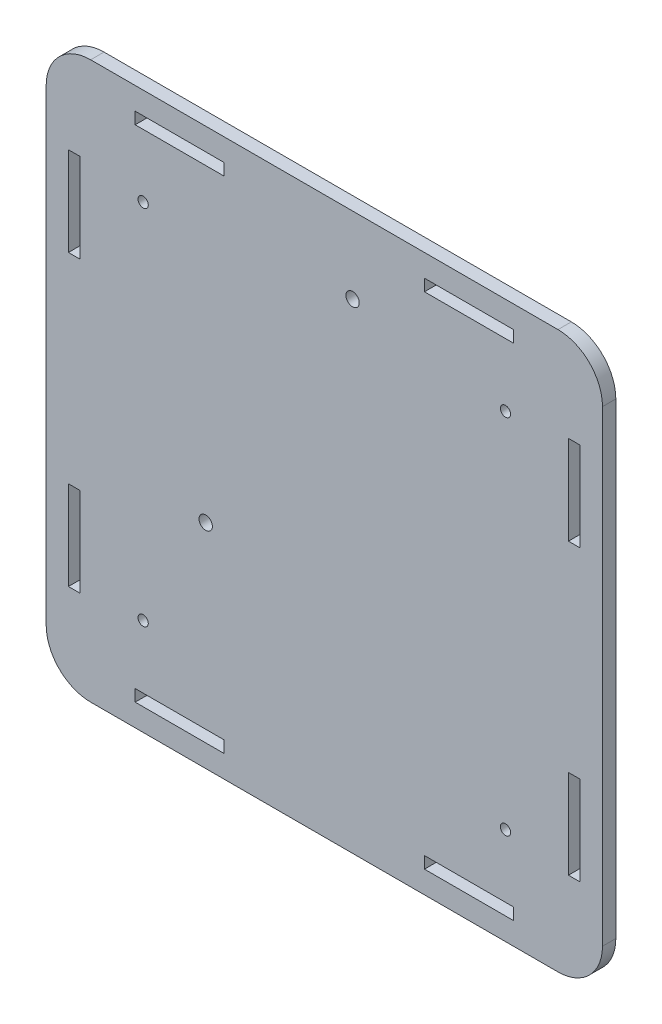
ISO-10303-21;
HEADER;
FILE_DESCRIPTION(('STEP AP214'),'2;1');
FILE_NAME('part.step','',(''),(''),'','','');
FILE_SCHEMA(('AUTOMOTIVE_DESIGN { 1 0 10303 214 1 1 1 1 }'));
ENDSEC;
DATA;
#1=APPLICATION_CONTEXT('core data for automotive mechanical design processes');
#2=APPLICATION_PROTOCOL_DEFINITION('international standard','automotive_design',2000,#1);
#3=PRODUCT_CONTEXT('',#1,'mechanical');
#4=PRODUCT('Part','Part','',(#3));
#5=PRODUCT_RELATED_PRODUCT_CATEGORY('part','',(#4));
#6=PRODUCT_DEFINITION_FORMATION('','',#4);
#7=PRODUCT_DEFINITION_CONTEXT('part definition',#1,'design');
#8=PRODUCT_DEFINITION('design','',#6,#7);
#9=PRODUCT_DEFINITION_SHAPE('','',#8);
#10=(LENGTH_UNIT() NAMED_UNIT(*) SI_UNIT(.MILLI.,.METRE.));
#11=(NAMED_UNIT(*) PLANE_ANGLE_UNIT() SI_UNIT($,.RADIAN.));
#12=(NAMED_UNIT(*) SI_UNIT($,.STERADIAN.) SOLID_ANGLE_UNIT());
#13=UNCERTAINTY_MEASURE_WITH_UNIT(LENGTH_MEASURE(1.E-05),#10,'distance_accuracy_value','');
#14=(GEOMETRIC_REPRESENTATION_CONTEXT(3) GLOBAL_UNCERTAINTY_ASSIGNED_CONTEXT((#13)) GLOBAL_UNIT_ASSIGNED_CONTEXT((#10,
#11,#12)) REPRESENTATION_CONTEXT('',''));
#15=CARTESIAN_POINT('',(0.,0.,0.));
#16=DIRECTION('',(0.,0.,1.));
#17=DIRECTION('',(1.,0.,0.));
#18=AXIS2_PLACEMENT_3D('',#15,#16,#17);
#19=CARTESIAN_POINT('',(125.,0.,3.));
#20=DIRECTION('',(-1.,0.,0.));
#21=DIRECTION('',(0.,0.,1.));
#22=AXIS2_PLACEMENT_3D('',#19,#20,#21);
#23=PLANE('',#22);
#24=DIRECTION('',(0.,1.,0.));
#25=VECTOR('',#24,1.);
#26=CARTESIAN_POINT('',(125.,0.,0.));
#27=LINE('',#26,#25);
#28=CARTESIAN_POINT('',(125.,10.0000000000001,0.));
#29=VERTEX_POINT('',#28);
#30=CARTESIAN_POINT('',(125.,115.,0.));
#31=VERTEX_POINT('',#30);
#32=EDGE_CURVE('E552',#29,#31,#27,.T.);
#33=ORIENTED_EDGE('',*,*,#32,.T.);
#34=DIRECTION('',(0.,0.,-1.));
#35=VECTOR('',#34,1.);
#36=CARTESIAN_POINT('',(125.,115.,3.));
#37=LINE('',#36,#35);
#38=CARTESIAN_POINT('',(125.,115.,3.));
#39=VERTEX_POINT('',#38);
#40=EDGE_CURVE('E605',#31,#39,#37,.F.);
#41=ORIENTED_EDGE('',*,*,#40,.T.);
#42=DIRECTION('',(0.,1.,0.));
#43=VECTOR('',#42,1.);
#44=CARTESIAN_POINT('',(125.,0.,3.));
#45=LINE('',#44,#43);
#46=CARTESIAN_POINT('',(125.,10.0000000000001,3.));
#47=VERTEX_POINT('',#46);
#48=EDGE_CURVE('E553',#47,#39,#45,.T.);
#49=ORIENTED_EDGE('',*,*,#48,.F.);
#50=DIRECTION('',(0.,0.,-1.));
#51=VECTOR('',#50,1.);
#52=CARTESIAN_POINT('',(125.,10.0000000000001,3.));
#53=LINE('',#52,#51);
#54=EDGE_CURVE('E602',#47,#29,#53,.T.);
#55=ORIENTED_EDGE('',*,*,#54,.T.);
#56=EDGE_LOOP('',(#33,#41,#49,#55));
#57=FACE_BOUND('',#56,.T.);
#58=ADVANCED_FACE('F33',(#57),#23,.F.);
#59=CARTESIAN_POINT('',(0.,125.,3.));
#60=DIRECTION('',(0.,-1.,0.));
#61=DIRECTION('',(1.,0.,0.));
#62=AXIS2_PLACEMENT_3D('',#59,#60,#61);
#63=PLANE('',#62);
#64=DIRECTION('',(-1.,0.,0.));
#65=VECTOR('',#64,1.);
#66=CARTESIAN_POINT('',(0.,125.,0.));
#67=LINE('',#66,#65);
#68=CARTESIAN_POINT('',(115.,125.,0.));
#69=VERTEX_POINT('',#68);
#70=CARTESIAN_POINT('',(9.99999999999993,125.,0.));
#71=VERTEX_POINT('',#70);
#72=EDGE_CURVE('E569',#69,#71,#67,.T.);
#73=ORIENTED_EDGE('',*,*,#72,.T.);
#74=DIRECTION('',(0.,0.,-1.));
#75=VECTOR('',#74,1.);
#76=CARTESIAN_POINT('',(9.99999999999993,125.,3.));
#77=LINE('',#76,#75);
#78=CARTESIAN_POINT('',(9.99999999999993,125.,3.));
#79=VERTEX_POINT('',#78);
#80=EDGE_CURVE('E592',#71,#79,#77,.F.);
#81=ORIENTED_EDGE('',*,*,#80,.T.);
#82=DIRECTION('',(-1.,0.,0.));
#83=VECTOR('',#82,1.);
#84=CARTESIAN_POINT('',(0.,125.,3.));
#85=LINE('',#84,#83);
#86=CARTESIAN_POINT('',(115.,125.,3.));
#87=VERTEX_POINT('',#86);
#88=EDGE_CURVE('E556',#87,#79,#85,.T.);
#89=ORIENTED_EDGE('',*,*,#88,.F.);
#90=DIRECTION('',(0.,0.,-1.));
#91=VECTOR('',#90,1.);
#92=CARTESIAN_POINT('',(115.,125.,3.));
#93=LINE('',#92,#91);
#94=EDGE_CURVE('E589',#87,#69,#93,.T.);
#95=ORIENTED_EDGE('',*,*,#94,.T.);
#96=EDGE_LOOP('',(#73,#81,#89,#95));
#97=FACE_BOUND('',#96,.T.);
#98=ADVANCED_FACE('F634',(#97),#63,.F.);
#99=CARTESIAN_POINT('',(0.,4.57442943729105E-13,3.));
#100=DIRECTION('',(1.,0.,0.));
#101=DIRECTION('',(0.,0.,-1.));
#102=AXIS2_PLACEMENT_3D('',#99,#100,#101);
#103=PLANE('',#102);
#104=DIRECTION('',(0.,-1.,0.));
#105=VECTOR('',#104,1.);
#106=CARTESIAN_POINT('',(0.,4.57442943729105E-13,3.));
#107=LINE('',#106,#105);
#108=CARTESIAN_POINT('',(0.,115.,3.));
#109=VERTEX_POINT('',#108);
#110=CARTESIAN_POINT('',(0.,10.0000000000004,3.));
#111=VERTEX_POINT('',#110);
#112=EDGE_CURVE('E560',#109,#111,#107,.T.);
#113=ORIENTED_EDGE('',*,*,#112,.F.);
#114=DIRECTION('',(0.,0.,-1.));
#115=VECTOR('',#114,1.);
#116=CARTESIAN_POINT('',(0.,115.,3.));
#117=LINE('',#116,#115);
#118=CARTESIAN_POINT('',(0.,115.,0.));
#119=VERTEX_POINT('',#118);
#120=EDGE_CURVE('E578',#109,#119,#117,.T.);
#121=ORIENTED_EDGE('',*,*,#120,.T.);
#122=DIRECTION('',(0.,-1.,0.));
#123=VECTOR('',#122,1.);
#124=CARTESIAN_POINT('',(0.,4.57442943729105E-13,0.));
#125=LINE('',#124,#123);
#126=CARTESIAN_POINT('',(0.,10.0000000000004,0.));
#127=VERTEX_POINT('',#126);
#128=EDGE_CURVE('E572',#119,#127,#125,.T.);
#129=ORIENTED_EDGE('',*,*,#128,.T.);
#130=DIRECTION('',(0.,0.,-1.));
#131=VECTOR('',#130,1.);
#132=CARTESIAN_POINT('',(0.,10.0000000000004,3.));
#133=LINE('',#132,#131);
#134=EDGE_CURVE('E566',#127,#111,#133,.F.);
#135=ORIENTED_EDGE('',*,*,#134,.T.);
#136=EDGE_LOOP('',(#113,#121,#129,#135));
#137=FACE_BOUND('',#136,.T.);
#138=ADVANCED_FACE('F642',(#137),#103,.F.);
#139=CARTESIAN_POINT('',(0.,4.57442943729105E-13,3.));
#140=DIRECTION('',(0.,1.,0.));
#141=DIRECTION('',(-1.,0.,0.));
#142=AXIS2_PLACEMENT_3D('',#139,#140,#141);
#143=PLANE('',#142);
#144=DIRECTION('',(1.,0.,0.));
#145=VECTOR('',#144,1.);
#146=CARTESIAN_POINT('',(0.,4.57442943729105E-13,0.));
#147=LINE('',#146,#145);
#148=CARTESIAN_POINT('',(9.9999999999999,4.2231310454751E-13,0.));
#149=VERTEX_POINT('',#148);
#150=CARTESIAN_POINT('',(115.,0.,0.));
#151=VERTEX_POINT('',#150);
#152=EDGE_CURVE('E557',#149,#151,#147,.T.);
#153=ORIENTED_EDGE('',*,*,#152,.T.);
#154=DIRECTION('',(0.,0.,-1.));
#155=VECTOR('',#154,1.);
#156=CARTESIAN_POINT('',(115.,0.,3.));
#157=LINE('',#156,#155);
#158=CARTESIAN_POINT('',(115.,0.,3.));
#159=VERTEX_POINT('',#158);
#160=EDGE_CURVE('E11',#151,#159,#157,.F.);
#161=ORIENTED_EDGE('',*,*,#160,.T.);
#162=DIRECTION('',(1.,0.,0.));
#163=VECTOR('',#162,1.);
#164=CARTESIAN_POINT('',(0.,4.57442943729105E-13,3.));
#165=LINE('',#164,#163);
#166=CARTESIAN_POINT('',(9.9999999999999,4.2231310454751E-13,3.));
#167=VERTEX_POINT('',#166);
#168=EDGE_CURVE('E563',#167,#159,#165,.T.);
#169=ORIENTED_EDGE('',*,*,#168,.F.);
#170=DIRECTION('',(0.,0.,-1.));
#171=VECTOR('',#170,1.);
#172=CARTESIAN_POINT('',(9.9999999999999,4.2231310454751E-13,3.));
#173=LINE('',#172,#171);
#174=EDGE_CURVE('E41',#167,#149,#173,.T.);
#175=ORIENTED_EDGE('',*,*,#174,.T.);
#176=EDGE_LOOP('',(#153,#161,#169,#175));
#177=FACE_BOUND('',#176,.T.);
#178=ADVANCED_FACE('F611',(#177),#143,.F.);
#179=CARTESIAN_POINT('',(0.,0.,3.));
#180=DIRECTION('',(0.,0.,-1.));
#181=DIRECTION('',(-1.,0.,0.));
#182=AXIS2_PLACEMENT_3D('',#179,#180,#181);
#183=PLANE('',#182);
#184=CARTESIAN_POINT('',(21.7921356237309,21.7921356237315,3.));
#185=DIRECTION('',(0.,0.,1.));
#186=DIRECTION('',(1.,0.,0.));
#187=AXIS2_PLACEMENT_3D('',#184,#185,#186);
#188=CIRCLE('',#187,1.15);
#189=CARTESIAN_POINT('',(22.9421356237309,21.7921356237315,3.));
#190=VERTEX_POINT('',#189);
#191=EDGE_CURVE('E1104',#190,#190,#188,.T.);
#192=ORIENTED_EDGE('',*,*,#191,.F.);
#193=EDGE_LOOP('',(#192));
#194=FACE_BOUND('',#193,.T.);
#195=CARTESIAN_POINT('',(103.207864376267,21.7921356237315,3.));
#196=DIRECTION('',(0.,0.,1.));
#197=DIRECTION('',(1.,0.,0.));
#198=AXIS2_PLACEMENT_3D('',#195,#196,#197);
#199=CIRCLE('',#198,1.15000000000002);
#200=CARTESIAN_POINT('',(104.357864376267,21.7921356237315,3.));
#201=VERTEX_POINT('',#200);
#202=EDGE_CURVE('E1108',#201,#201,#199,.T.);
#203=ORIENTED_EDGE('',*,*,#202,.F.);
#204=EDGE_LOOP('',(#203));
#205=FACE_BOUND('',#204,.T.);
#206=CARTESIAN_POINT('',(103.207864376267,103.207864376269,3.));
#207=DIRECTION('',(0.,0.,1.));
#208=DIRECTION('',(1.,0.,0.));
#209=AXIS2_PLACEMENT_3D('',#206,#207,#208);
#210=CIRCLE('',#209,1.15000000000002);
#211=CARTESIAN_POINT('',(104.357864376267,103.207864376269,3.));
#212=VERTEX_POINT('',#211);
#213=EDGE_CURVE('E1120',#212,#212,#210,.T.);
#214=ORIENTED_EDGE('',*,*,#213,.F.);
#215=EDGE_LOOP('',(#214));
#216=FACE_BOUND('',#215,.T.);
#217=CARTESIAN_POINT('',(21.7921356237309,103.207864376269,3.));
#218=DIRECTION('',(0.,0.,1.));
#219=DIRECTION('',(1.,0.,0.));
#220=AXIS2_PLACEMENT_3D('',#217,#218,#219);
#221=CIRCLE('',#220,1.15);
#222=CARTESIAN_POINT('',(22.9421356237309,103.207864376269,3.));
#223=VERTEX_POINT('',#222);
#224=EDGE_CURVE('E1113',#223,#223,#221,.T.);
#225=ORIENTED_EDGE('',*,*,#224,.F.);
#226=EDGE_LOOP('',(#225));
#227=FACE_BOUND('',#226,.T.);
#228=CARTESIAN_POINT('',(35.85,47.85,3.));
#229=DIRECTION('',(0.,0.,1.));
#230=DIRECTION('',(1.,0.,0.));
#231=AXIS2_PLACEMENT_3D('',#228,#229,#230);
#232=CIRCLE('',#231,1.5);
#233=CARTESIAN_POINT('',(37.35,47.85,3.));
#234=VERTEX_POINT('',#233);
#235=EDGE_CURVE('E377',#234,#234,#232,.T.);
#236=ORIENTED_EDGE('',*,*,#235,.F.);
#237=EDGE_LOOP('',(#236));
#238=FACE_BOUND('',#237,.T.);
#239=CARTESIAN_POINT('',(68.85,107.85,3.));
#240=DIRECTION('',(0.,0.,1.));
#241=DIRECTION('',(1.,0.,0.));
#242=AXIS2_PLACEMENT_3D('',#239,#240,#241);
#243=CIRCLE('',#242,1.5);
#244=CARTESIAN_POINT('',(70.35,107.85,3.));
#245=VERTEX_POINT('',#244);
#246=EDGE_CURVE('E1126',#245,#245,#243,.T.);
#247=ORIENTED_EDGE('',*,*,#246,.F.);
#248=EDGE_LOOP('',(#247));
#249=FACE_BOUND('',#248,.T.);
#250=DIRECTION('',(1.,0.,0.));
#251=VECTOR('',#250,1.);
#252=CARTESIAN_POINT('',(4.99999999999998,85.,3.));
#253=LINE('',#252,#251);
#254=CARTESIAN_POINT('',(4.99999999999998,85.,3.));
#255=VERTEX_POINT('',#254);
#256=CARTESIAN_POINT('',(7.64999999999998,85.,3.));
#257=VERTEX_POINT('',#256);
#258=EDGE_CURVE('E399',#255,#257,#253,.T.);
#259=ORIENTED_EDGE('',*,*,#258,.F.);
#260=DIRECTION('',(0.,-1.,0.));
#261=VECTOR('',#260,1.);
#262=CARTESIAN_POINT('',(4.99999999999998,105.,3.));
#263=LINE('',#262,#261);
#264=CARTESIAN_POINT('',(4.99999999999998,105.,3.));
#265=VERTEX_POINT('',#264);
#266=EDGE_CURVE('E402',#265,#255,#263,.T.);
#267=ORIENTED_EDGE('',*,*,#266,.F.);
#268=DIRECTION('',(-1.,0.,0.));
#269=VECTOR('',#268,1.);
#270=CARTESIAN_POINT('',(4.99999999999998,105.,3.));
#271=LINE('',#270,#269);
#272=CARTESIAN_POINT('',(7.64999999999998,105.,3.));
#273=VERTEX_POINT('',#272);
#274=EDGE_CURVE('E405',#273,#265,#271,.T.);
#275=ORIENTED_EDGE('',*,*,#274,.F.);
#276=DIRECTION('',(0.,1.,0.));
#277=VECTOR('',#276,1.);
#278=CARTESIAN_POINT('',(7.64999999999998,105.,3.));
#279=LINE('',#278,#277);
#280=EDGE_CURVE('E48',#257,#273,#279,.T.);
#281=ORIENTED_EDGE('',*,*,#280,.F.);
#282=EDGE_LOOP('',(#259,#267,#275,#281));
#283=FACE_BOUND('',#282,.T.);
#284=DIRECTION('',(0.,1.,0.));
#285=VECTOR('',#284,1.);
#286=CARTESIAN_POINT('',(39.999999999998,7.65000000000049,3.));
#287=LINE('',#286,#285);
#288=CARTESIAN_POINT('',(39.999999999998,5.0000000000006,3.));
#289=VERTEX_POINT('',#288);
#290=CARTESIAN_POINT('',(39.999999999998,7.65000000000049,3.));
#291=VERTEX_POINT('',#290);
#292=EDGE_CURVE('E431',#289,#291,#287,.T.);
#293=ORIENTED_EDGE('',*,*,#292,.F.);
#294=DIRECTION('',(1.,0.,0.));
#295=VECTOR('',#294,1.);
#296=CARTESIAN_POINT('',(19.999999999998,5.0000000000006,3.));
#297=LINE('',#296,#295);
#298=CARTESIAN_POINT('',(19.999999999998,5.0000000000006,3.));
#299=VERTEX_POINT('',#298);
#300=EDGE_CURVE('E434',#299,#289,#297,.T.);
#301=ORIENTED_EDGE('',*,*,#300,.F.);
#302=DIRECTION('',(0.,-1.,0.));
#303=VECTOR('',#302,1.);
#304=CARTESIAN_POINT('',(19.9999999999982,7.65000000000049,3.));
#305=LINE('',#304,#303);
#306=CARTESIAN_POINT('',(19.9999999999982,7.65000000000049,3.));
#307=VERTEX_POINT('',#306);
#308=EDGE_CURVE('E437',#307,#299,#305,.T.);
#309=ORIENTED_EDGE('',*,*,#308,.F.);
#310=DIRECTION('',(-1.,0.,0.));
#311=VECTOR('',#310,1.);
#312=CARTESIAN_POINT('',(19.9999999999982,7.65000000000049,3.));
#313=LINE('',#312,#311);
#314=EDGE_CURVE('E56',#291,#307,#313,.T.);
#315=ORIENTED_EDGE('',*,*,#314,.F.);
#316=EDGE_LOOP('',(#293,#301,#309,#315));
#317=FACE_BOUND('',#316,.T.);
#318=DIRECTION('',(0.,-1.,0.));
#319=VECTOR('',#318,1.);
#320=CARTESIAN_POINT('',(117.35,105.,3.));
#321=LINE('',#320,#319);
#322=CARTESIAN_POINT('',(117.35,105.,3.));
#323=VERTEX_POINT('',#322);
#324=CARTESIAN_POINT('',(117.35,85.,3.));
#325=VERTEX_POINT('',#324);
#326=EDGE_CURVE('E462',#323,#325,#321,.T.);
#327=ORIENTED_EDGE('',*,*,#326,.F.);
#328=DIRECTION('',(-1.,0.,0.));
#329=VECTOR('',#328,1.);
#330=CARTESIAN_POINT('',(120.,105.,3.));
#331=LINE('',#330,#329);
#332=CARTESIAN_POINT('',(120.,105.,3.));
#333=VERTEX_POINT('',#332);
#334=EDGE_CURVE('E465',#333,#323,#331,.T.);
#335=ORIENTED_EDGE('',*,*,#334,.F.);
#336=DIRECTION('',(0.,1.,0.));
#337=VECTOR('',#336,1.);
#338=CARTESIAN_POINT('',(120.,105.,3.));
#339=LINE('',#338,#337);
#340=CARTESIAN_POINT('',(120.,85.0000000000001,3.));
#341=VERTEX_POINT('',#340);
#342=EDGE_CURVE('E468',#341,#333,#339,.T.);
#343=ORIENTED_EDGE('',*,*,#342,.F.);
#344=DIRECTION('',(1.,0.,0.));
#345=VECTOR('',#344,1.);
#346=CARTESIAN_POINT('',(120.,85.0000000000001,3.));
#347=LINE('',#346,#345);
#348=EDGE_CURVE('E459',#325,#341,#347,.T.);
#349=ORIENTED_EDGE('',*,*,#348,.F.);
#350=EDGE_LOOP('',(#327,#335,#343,#349));
#351=FACE_BOUND('',#350,.T.);
#352=DIRECTION('',(-1.,2.14712943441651E-13,0.));
#353=VECTOR('',#352,1.);
#354=CARTESIAN_POINT('',(120.,40.,3.));
#355=LINE('',#354,#353);
#356=CARTESIAN_POINT('',(120.,40.,3.));
#357=VERTEX_POINT('',#356);
#358=CARTESIAN_POINT('',(117.35,40.0000000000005,3.));
#359=VERTEX_POINT('',#358);
#360=EDGE_CURVE('E494',#357,#359,#355,.T.);
#361=ORIENTED_EDGE('',*,*,#360,.F.);
#362=DIRECTION('',(0.,1.,0.));
#363=VECTOR('',#362,1.);
#364=CARTESIAN_POINT('',(120.,19.9999999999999,3.));
#365=LINE('',#364,#363);
#366=CARTESIAN_POINT('',(120.,19.9999999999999,3.));
#367=VERTEX_POINT('',#366);
#368=EDGE_CURVE('E497',#367,#357,#365,.T.);
#369=ORIENTED_EDGE('',*,*,#368,.F.);
#370=DIRECTION('',(1.,-2.14712943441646E-13,0.));
#371=VECTOR('',#370,1.);
#372=CARTESIAN_POINT('',(120.,19.9999999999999,3.));
#373=LINE('',#372,#371);
#374=CARTESIAN_POINT('',(117.35,20.0000000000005,3.));
#375=VERTEX_POINT('',#374);
#376=EDGE_CURVE('E331',#375,#367,#373,.T.);
#377=ORIENTED_EDGE('',*,*,#376,.F.);
#378=DIRECTION('',(0.,-1.,0.));
#379=VECTOR('',#378,1.);
#380=CARTESIAN_POINT('',(117.35,20.0000000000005,3.));
#381=LINE('',#380,#379);
#382=EDGE_CURVE('E491',#359,#375,#381,.T.);
#383=ORIENTED_EDGE('',*,*,#382,.F.);
#384=EDGE_LOOP('',(#361,#369,#377,#383));
#385=FACE_BOUND('',#384,.T.);
#386=DIRECTION('',(1.,0.,0.));
#387=VECTOR('',#386,1.);
#388=CARTESIAN_POINT('',(105.000000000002,5.00000000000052,3.));
#389=LINE('',#388,#387);
#390=CARTESIAN_POINT('',(85.0000000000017,5.00000000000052,3.));
#391=VERTEX_POINT('',#390);
#392=CARTESIAN_POINT('',(105.000000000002,5.00000000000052,3.));
#393=VERTEX_POINT('',#392);
#394=EDGE_CURVE('E316',#391,#393,#389,.T.);
#395=ORIENTED_EDGE('',*,*,#394,.F.);
#396=DIRECTION('',(0.,-1.,0.));
#397=VECTOR('',#396,1.);
#398=CARTESIAN_POINT('',(85.0000000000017,7.65000000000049,3.));
#399=LINE('',#398,#397);
#400=CARTESIAN_POINT('',(85.0000000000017,7.65000000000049,3.));
#401=VERTEX_POINT('',#400);
#402=EDGE_CURVE('E308',#401,#391,#399,.T.);
#403=ORIENTED_EDGE('',*,*,#402,.F.);
#404=DIRECTION('',(-1.,0.,0.));
#405=VECTOR('',#404,1.);
#406=CARTESIAN_POINT('',(105.000000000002,7.65000000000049,3.));
#407=LINE('',#406,#405);
#408=CARTESIAN_POINT('',(105.000000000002,7.65000000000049,3.));
#409=VERTEX_POINT('',#408);
#410=EDGE_CURVE('E320',#409,#401,#407,.T.);
#411=ORIENTED_EDGE('',*,*,#410,.F.);
#412=DIRECTION('',(0.,1.,0.));
#413=VECTOR('',#412,1.);
#414=CARTESIAN_POINT('',(105.000000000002,7.65000000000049,3.));
#415=LINE('',#414,#413);
#416=EDGE_CURVE('E314',#393,#409,#415,.T.);
#417=ORIENTED_EDGE('',*,*,#416,.F.);
#418=EDGE_LOOP('',(#395,#403,#411,#417));
#419=FACE_BOUND('',#418,.T.);
#420=DIRECTION('',(0.,-1.,0.));
#421=VECTOR('',#420,1.);
#422=CARTESIAN_POINT('',(85.0000000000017,117.35,3.));
#423=LINE('',#422,#421);
#424=CARTESIAN_POINT('',(85.0000000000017,120.,3.));
#425=VERTEX_POINT('',#424);
#426=CARTESIAN_POINT('',(85.0000000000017,117.35,3.));
#427=VERTEX_POINT('',#426);
#428=EDGE_CURVE('E335',#425,#427,#423,.T.);
#429=ORIENTED_EDGE('',*,*,#428,.F.);
#430=DIRECTION('',(-1.,0.,0.));
#431=VECTOR('',#430,1.);
#432=CARTESIAN_POINT('',(105.000000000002,120.,3.));
#433=LINE('',#432,#431);
#434=CARTESIAN_POINT('',(105.000000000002,120.,3.));
#435=VERTEX_POINT('',#434);
#436=EDGE_CURVE('E338',#435,#425,#433,.T.);
#437=ORIENTED_EDGE('',*,*,#436,.F.);
#438=DIRECTION('',(0.,1.,0.));
#439=VECTOR('',#438,1.);
#440=CARTESIAN_POINT('',(105.000000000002,117.35,3.));
#441=LINE('',#440,#439);
#442=CARTESIAN_POINT('',(105.000000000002,117.35,3.));
#443=VERTEX_POINT('',#442);
#444=EDGE_CURVE('E341',#443,#435,#441,.T.);
#445=ORIENTED_EDGE('',*,*,#444,.F.);
#446=DIRECTION('',(1.,0.,0.));
#447=VECTOR('',#446,1.);
#448=CARTESIAN_POINT('',(105.000000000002,117.35,3.));
#449=LINE('',#448,#447);
#450=EDGE_CURVE('E332',#427,#443,#449,.T.);
#451=ORIENTED_EDGE('',*,*,#450,.F.);
#452=EDGE_LOOP('',(#429,#437,#445,#451));
#453=FACE_BOUND('',#452,.T.);
#454=DIRECTION('',(-1.,0.,0.));
#455=VECTOR('',#454,1.);
#456=CARTESIAN_POINT('',(19.999999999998,120.,3.));
#457=LINE('',#456,#455);
#458=CARTESIAN_POINT('',(39.999999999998,120.,3.));
#459=VERTEX_POINT('',#458);
#460=CARTESIAN_POINT('',(19.999999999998,120.,3.));
#461=VERTEX_POINT('',#460);
#462=EDGE_CURVE('E368',#459,#461,#457,.T.);
#463=ORIENTED_EDGE('',*,*,#462,.F.);
#464=DIRECTION('',(0.,1.,0.));
#465=VECTOR('',#464,1.);
#466=CARTESIAN_POINT('',(39.999999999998,117.35,3.));
#467=LINE('',#466,#465);
#468=CARTESIAN_POINT('',(39.999999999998,117.35,3.));
#469=VERTEX_POINT('',#468);
#470=EDGE_CURVE('E371',#469,#459,#467,.T.);
#471=ORIENTED_EDGE('',*,*,#470,.F.);
#472=DIRECTION('',(1.,0.,0.));
#473=VECTOR('',#472,1.);
#474=CARTESIAN_POINT('',(19.9999999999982,117.35,3.));
#475=LINE('',#474,#473);
#476=CARTESIAN_POINT('',(19.9999999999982,117.35,3.));
#477=VERTEX_POINT('',#476);
#478=EDGE_CURVE('E374',#477,#469,#475,.T.);
#479=ORIENTED_EDGE('',*,*,#478,.F.);
#480=DIRECTION('',(0.,-1.,0.));
#481=VECTOR('',#480,1.);
#482=CARTESIAN_POINT('',(19.9999999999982,117.35,3.));
#483=LINE('',#482,#481);
#484=EDGE_CURVE('E365',#461,#477,#483,.T.);
#485=ORIENTED_EDGE('',*,*,#484,.F.);
#486=EDGE_LOOP('',(#463,#471,#479,#485));
#487=FACE_BOUND('',#486,.T.);
#488=DIRECTION('',(0.,1.,0.));
#489=VECTOR('',#488,1.);
#490=CARTESIAN_POINT('',(7.64999999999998,20.0000000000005,3.));
#491=LINE('',#490,#489);
#492=CARTESIAN_POINT('',(7.64999999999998,20.0000000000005,3.));
#493=VERTEX_POINT('',#492);
#494=CARTESIAN_POINT('',(7.64999999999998,40.0000000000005,3.));
#495=VERTEX_POINT('',#494);
#496=EDGE_CURVE('E524',#493,#495,#491,.T.);
#497=ORIENTED_EDGE('',*,*,#496,.F.);
#498=DIRECTION('',(1.,0.,0.));
#499=VECTOR('',#498,1.);
#500=CARTESIAN_POINT('',(4.99999999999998,20.0000000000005,3.));
#501=LINE('',#500,#499);
#502=CARTESIAN_POINT('',(4.99999999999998,20.0000000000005,3.));
#503=VERTEX_POINT('',#502);
#504=EDGE_CURVE('E527',#503,#493,#501,.T.);
#505=ORIENTED_EDGE('',*,*,#504,.F.);
#506=DIRECTION('',(0.,-1.,0.));
#507=VECTOR('',#506,1.);
#508=CARTESIAN_POINT('',(4.99999999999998,20.0000000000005,3.));
#509=LINE('',#508,#507);
#510=CARTESIAN_POINT('',(4.99999999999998,40.0000000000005,3.));
#511=VERTEX_POINT('',#510);
#512=EDGE_CURVE('E428',#511,#503,#509,.T.);
#513=ORIENTED_EDGE('',*,*,#512,.F.);
#514=DIRECTION('',(-1.,0.,0.));
#515=VECTOR('',#514,1.);
#516=CARTESIAN_POINT('',(4.99999999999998,40.0000000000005,3.));
#517=LINE('',#516,#515);
#518=EDGE_CURVE('E521',#495,#511,#517,.T.);
#519=ORIENTED_EDGE('',*,*,#518,.F.);
#520=EDGE_LOOP('',(#497,#505,#513,#519));
#521=FACE_BOUND('',#520,.T.);
#522=ORIENTED_EDGE('',*,*,#88,.T.);
#523=CARTESIAN_POINT('',(9.99999999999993,115.,3.));
#524=DIRECTION('',(0.,0.,-1.));
#525=DIRECTION('',(-1.,0.,0.));
#526=AXIS2_PLACEMENT_3D('',#523,#524,#525);
#527=CIRCLE('',#526,10.);
#528=EDGE_CURVE('E600',#79,#109,#527,.F.);
#529=ORIENTED_EDGE('',*,*,#528,.T.);
#530=ORIENTED_EDGE('',*,*,#112,.T.);
#531=CARTESIAN_POINT('',(9.99999999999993,10.0000000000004,3.));
#532=DIRECTION('',(0.,0.,-1.));
#533=DIRECTION('',(-1.,0.,0.));
#534=AXIS2_PLACEMENT_3D('',#531,#532,#533);
#535=CIRCLE('',#534,10.);
#536=EDGE_CURVE('E594',#111,#167,#535,.F.);
#537=ORIENTED_EDGE('',*,*,#536,.T.);
#538=ORIENTED_EDGE('',*,*,#168,.T.);
#539=CARTESIAN_POINT('',(115.,10.0000000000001,3.));
#540=DIRECTION('',(0.,0.,-1.));
#541=DIRECTION('',(-1.,0.,0.));
#542=AXIS2_PLACEMENT_3D('',#539,#540,#541);
#543=CIRCLE('',#542,10.);
#544=EDGE_CURVE('E596',#159,#47,#543,.F.);
#545=ORIENTED_EDGE('',*,*,#544,.T.);
#546=ORIENTED_EDGE('',*,*,#48,.T.);
#547=CARTESIAN_POINT('',(115.,115.,3.));
#548=DIRECTION('',(0.,0.,-1.));
#549=DIRECTION('',(-1.,0.,0.));
#550=AXIS2_PLACEMENT_3D('',#547,#548,#549);
#551=CIRCLE('',#550,10.);
#552=EDGE_CURVE('E598',#39,#87,#551,.F.);
#553=ORIENTED_EDGE('',*,*,#552,.T.);
#554=EDGE_LOOP('',(#522,#529,#530,#537,#538,#545,#546,#553));
#555=FACE_BOUND('',#554,.T.);
#556=ADVANCED_FACE('F627',(#194,#205,#216,#227,#238,#249,#283,#317,#351,#385,#419,#453,#487,
#521,#555),#183,.F.);
#557=CARTESIAN_POINT('',(0.,0.,0.));
#558=DIRECTION('',(0.,0.,-1.));
#559=DIRECTION('',(-1.,0.,0.));
#560=AXIS2_PLACEMENT_3D('',#557,#558,#559);
#561=PLANE('',#560);
#562=CARTESIAN_POINT('',(21.7921356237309,21.7921356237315,0.));
#563=DIRECTION('',(0.,0.,-1.));
#564=DIRECTION('',(-1.,0.,0.));
#565=AXIS2_PLACEMENT_3D('',#562,#563,#564);
#566=CIRCLE('',#565,1.15);
#567=CARTESIAN_POINT('',(20.6421356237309,21.7921356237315,0.));
#568=VERTEX_POINT('',#567);
#569=EDGE_CURVE('E1101',#568,#568,#566,.F.);
#570=ORIENTED_EDGE('',*,*,#569,.T.);
#571=EDGE_LOOP('',(#570));
#572=FACE_BOUND('',#571,.T.);
#573=CARTESIAN_POINT('',(103.207864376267,21.7921356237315,0.));
#574=DIRECTION('',(0.,0.,-1.));
#575=DIRECTION('',(-1.,0.,0.));
#576=AXIS2_PLACEMENT_3D('',#573,#574,#575);
#577=CIRCLE('',#576,1.15000000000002);
#578=CARTESIAN_POINT('',(102.057864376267,21.7921356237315,0.));
#579=VERTEX_POINT('',#578);
#580=EDGE_CURVE('E1105',#579,#579,#577,.F.);
#581=ORIENTED_EDGE('',*,*,#580,.T.);
#582=EDGE_LOOP('',(#581));
#583=FACE_BOUND('',#582,.T.);
#584=CARTESIAN_POINT('',(103.207864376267,103.207864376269,0.));
#585=DIRECTION('',(0.,0.,-1.));
#586=DIRECTION('',(-1.,0.,0.));
#587=AXIS2_PLACEMENT_3D('',#584,#585,#586);
#588=CIRCLE('',#587,1.15000000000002);
#589=CARTESIAN_POINT('',(102.057864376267,103.207864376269,0.));
#590=VERTEX_POINT('',#589);
#591=EDGE_CURVE('E1214',#590,#590,#588,.F.);
#592=ORIENTED_EDGE('',*,*,#591,.T.);
#593=EDGE_LOOP('',(#592));
#594=FACE_BOUND('',#593,.T.);
#595=CARTESIAN_POINT('',(21.7921356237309,103.207864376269,0.));
#596=DIRECTION('',(0.,0.,-1.));
#597=DIRECTION('',(-1.,0.,0.));
#598=AXIS2_PLACEMENT_3D('',#595,#596,#597);
#599=CIRCLE('',#598,1.15);
#600=CARTESIAN_POINT('',(20.6421356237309,103.207864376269,0.));
#601=VERTEX_POINT('',#600);
#602=EDGE_CURVE('E1117',#601,#601,#599,.F.);
#603=ORIENTED_EDGE('',*,*,#602,.T.);
#604=EDGE_LOOP('',(#603));
#605=FACE_BOUND('',#604,.T.);
#606=CARTESIAN_POINT('',(35.85,47.85,0.));
#607=DIRECTION('',(0.,0.,-1.));
#608=DIRECTION('',(-1.,0.,0.));
#609=AXIS2_PLACEMENT_3D('',#606,#607,#608);
#610=CIRCLE('',#609,1.5);
#611=CARTESIAN_POINT('',(34.35,47.85,0.));
#612=VERTEX_POINT('',#611);
#613=EDGE_CURVE('E1123',#612,#612,#610,.F.);
#614=ORIENTED_EDGE('',*,*,#613,.T.);
#615=EDGE_LOOP('',(#614));
#616=FACE_BOUND('',#615,.T.);
#617=CARTESIAN_POINT('',(68.85,107.85,0.));
#618=DIRECTION('',(0.,0.,-1.));
#619=DIRECTION('',(-1.,0.,0.));
#620=AXIS2_PLACEMENT_3D('',#617,#618,#619);
#621=CIRCLE('',#620,1.5);
#622=CARTESIAN_POINT('',(67.35,107.85,0.));
#623=VERTEX_POINT('',#622);
#624=EDGE_CURVE('E1116',#623,#623,#621,.F.);
#625=ORIENTED_EDGE('',*,*,#624,.T.);
#626=EDGE_LOOP('',(#625));
#627=FACE_BOUND('',#626,.T.);
#628=DIRECTION('',(0.,-1.,0.));
#629=VECTOR('',#628,1.);
#630=CARTESIAN_POINT('',(4.99999999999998,105.,0.));
#631=LINE('',#630,#629);
#632=CARTESIAN_POINT('',(4.99999999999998,105.,0.));
#633=VERTEX_POINT('',#632);
#634=CARTESIAN_POINT('',(4.99999999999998,85.,0.));
#635=VERTEX_POINT('',#634);
#636=EDGE_CURVE('E398',#633,#635,#631,.T.);
#637=ORIENTED_EDGE('',*,*,#636,.T.);
#638=DIRECTION('',(1.,0.,0.));
#639=VECTOR('',#638,1.);
#640=CARTESIAN_POINT('',(4.99999999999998,85.,0.));
#641=LINE('',#640,#639);
#642=CARTESIAN_POINT('',(7.64999999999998,85.,0.));
#643=VERTEX_POINT('',#642);
#644=EDGE_CURVE('E421',#635,#643,#641,.T.);
#645=ORIENTED_EDGE('',*,*,#644,.T.);
#646=DIRECTION('',(0.,1.,0.));
#647=VECTOR('',#646,1.);
#648=CARTESIAN_POINT('',(7.64999999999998,105.,0.));
#649=LINE('',#648,#647);
#650=CARTESIAN_POINT('',(7.64999999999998,105.,0.));
#651=VERTEX_POINT('',#650);
#652=EDGE_CURVE('E417',#643,#651,#649,.T.);
#653=ORIENTED_EDGE('',*,*,#652,.T.);
#654=DIRECTION('',(-1.,0.,0.));
#655=VECTOR('',#654,1.);
#656=CARTESIAN_POINT('',(4.99999999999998,105.,0.));
#657=LINE('',#656,#655);
#658=EDGE_CURVE('E412',#651,#633,#657,.T.);
#659=ORIENTED_EDGE('',*,*,#658,.T.);
#660=EDGE_LOOP('',(#637,#645,#653,#659));
#661=FACE_BOUND('',#660,.T.);
#662=DIRECTION('',(1.,0.,0.));
#663=VECTOR('',#662,1.);
#664=CARTESIAN_POINT('',(19.999999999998,5.0000000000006,0.));
#665=LINE('',#664,#663);
#666=CARTESIAN_POINT('',(19.999999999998,5.0000000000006,0.));
#667=VERTEX_POINT('',#666);
#668=CARTESIAN_POINT('',(39.999999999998,5.0000000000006,0.));
#669=VERTEX_POINT('',#668);
#670=EDGE_CURVE('E430',#667,#669,#665,.T.);
#671=ORIENTED_EDGE('',*,*,#670,.T.);
#672=DIRECTION('',(0.,1.,0.));
#673=VECTOR('',#672,1.);
#674=CARTESIAN_POINT('',(39.999999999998,7.65000000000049,0.));
#675=LINE('',#674,#673);
#676=CARTESIAN_POINT('',(39.999999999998,7.65000000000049,0.));
#677=VERTEX_POINT('',#676);
#678=EDGE_CURVE('E452',#669,#677,#675,.T.);
#679=ORIENTED_EDGE('',*,*,#678,.T.);
#680=DIRECTION('',(-1.,0.,0.));
#681=VECTOR('',#680,1.);
#682=CARTESIAN_POINT('',(19.9999999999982,7.65000000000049,0.));
#683=LINE('',#682,#681);
#684=CARTESIAN_POINT('',(19.9999999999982,7.65000000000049,0.));
#685=VERTEX_POINT('',#684);
#686=EDGE_CURVE('E448',#677,#685,#683,.T.);
#687=ORIENTED_EDGE('',*,*,#686,.T.);
#688=DIRECTION('',(0.,-1.,0.));
#689=VECTOR('',#688,1.);
#690=CARTESIAN_POINT('',(19.9999999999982,7.65000000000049,0.));
#691=LINE('',#690,#689);
#692=EDGE_CURVE('E444',#685,#667,#691,.T.);
#693=ORIENTED_EDGE('',*,*,#692,.T.);
#694=EDGE_LOOP('',(#671,#679,#687,#693));
#695=FACE_BOUND('',#694,.T.);
#696=DIRECTION('',(-1.,0.,0.));
#697=VECTOR('',#696,1.);
#698=CARTESIAN_POINT('',(120.,105.,0.));
#699=LINE('',#698,#697);
#700=CARTESIAN_POINT('',(120.,105.,0.));
#701=VERTEX_POINT('',#700);
#702=CARTESIAN_POINT('',(117.35,105.,0.));
#703=VERTEX_POINT('',#702);
#704=EDGE_CURVE('E461',#701,#703,#699,.T.);
#705=ORIENTED_EDGE('',*,*,#704,.T.);
#706=DIRECTION('',(0.,-1.,0.));
#707=VECTOR('',#706,1.);
#708=CARTESIAN_POINT('',(117.35,105.,0.));
#709=LINE('',#708,#707);
#710=CARTESIAN_POINT('',(117.35,85.,0.));
#711=VERTEX_POINT('',#710);
#712=EDGE_CURVE('E483',#703,#711,#709,.T.);
#713=ORIENTED_EDGE('',*,*,#712,.T.);
#714=DIRECTION('',(1.,0.,0.));
#715=VECTOR('',#714,1.);
#716=CARTESIAN_POINT('',(120.,85.0000000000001,0.));
#717=LINE('',#716,#715);
#718=CARTESIAN_POINT('',(120.,85.0000000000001,0.));
#719=VERTEX_POINT('',#718);
#720=EDGE_CURVE('E479',#711,#719,#717,.T.);
#721=ORIENTED_EDGE('',*,*,#720,.T.);
#722=DIRECTION('',(0.,1.,0.));
#723=VECTOR('',#722,1.);
#724=CARTESIAN_POINT('',(120.,105.,0.));
#725=LINE('',#724,#723);
#726=EDGE_CURVE('E475',#719,#701,#725,.T.);
#727=ORIENTED_EDGE('',*,*,#726,.T.);
#728=EDGE_LOOP('',(#705,#713,#721,#727));
#729=FACE_BOUND('',#728,.T.);
#730=DIRECTION('',(0.,1.,0.));
#731=VECTOR('',#730,1.);
#732=CARTESIAN_POINT('',(120.,19.9999999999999,0.));
#733=LINE('',#732,#731);
#734=CARTESIAN_POINT('',(120.,19.9999999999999,0.));
#735=VERTEX_POINT('',#734);
#736=CARTESIAN_POINT('',(120.,40.,0.));
#737=VERTEX_POINT('',#736);
#738=EDGE_CURVE('E493',#735,#737,#733,.T.);
#739=ORIENTED_EDGE('',*,*,#738,.T.);
#740=DIRECTION('',(-1.,2.14712943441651E-13,0.));
#741=VECTOR('',#740,1.);
#742=CARTESIAN_POINT('',(120.,40.,0.));
#743=LINE('',#742,#741);
#744=CARTESIAN_POINT('',(117.35,40.0000000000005,0.));
#745=VERTEX_POINT('',#744);
#746=EDGE_CURVE('E513',#737,#745,#743,.T.);
#747=ORIENTED_EDGE('',*,*,#746,.T.);
#748=DIRECTION('',(0.,-1.,0.));
#749=VECTOR('',#748,1.);
#750=CARTESIAN_POINT('',(117.35,20.0000000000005,0.));
#751=LINE('',#750,#749);
#752=CARTESIAN_POINT('',(117.35,20.0000000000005,0.));
#753=VERTEX_POINT('',#752);
#754=EDGE_CURVE('E509',#745,#753,#751,.T.);
#755=ORIENTED_EDGE('',*,*,#754,.T.);
#756=DIRECTION('',(1.,-2.14712943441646E-13,0.));
#757=VECTOR('',#756,1.);
#758=CARTESIAN_POINT('',(120.,19.9999999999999,0.));
#759=LINE('',#758,#757);
#760=EDGE_CURVE('E505',#753,#735,#759,.T.);
#761=ORIENTED_EDGE('',*,*,#760,.T.);
#762=EDGE_LOOP('',(#739,#747,#755,#761));
#763=FACE_BOUND('',#762,.T.);
#764=DIRECTION('',(0.,-1.,0.));
#765=VECTOR('',#764,1.);
#766=CARTESIAN_POINT('',(85.0000000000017,7.65000000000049,0.));
#767=LINE('',#766,#765);
#768=CARTESIAN_POINT('',(85.0000000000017,7.65000000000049,0.));
#769=VERTEX_POINT('',#768);
#770=CARTESIAN_POINT('',(85.0000000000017,5.00000000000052,0.));
#771=VERTEX_POINT('',#770);
#772=EDGE_CURVE('E305',#769,#771,#767,.T.);
#773=ORIENTED_EDGE('',*,*,#772,.T.);
#774=DIRECTION('',(1.,0.,0.));
#775=VECTOR('',#774,1.);
#776=CARTESIAN_POINT('',(105.000000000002,5.00000000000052,0.));
#777=LINE('',#776,#775);
#778=CARTESIAN_POINT('',(105.000000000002,5.00000000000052,0.));
#779=VERTEX_POINT('',#778);
#780=EDGE_CURVE('E291',#771,#779,#777,.T.);
#781=ORIENTED_EDGE('',*,*,#780,.T.);
#782=DIRECTION('',(0.,1.,0.));
#783=VECTOR('',#782,1.);
#784=CARTESIAN_POINT('',(105.000000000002,7.65000000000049,0.));
#785=LINE('',#784,#783);
#786=CARTESIAN_POINT('',(105.000000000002,7.65000000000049,0.));
#787=VERTEX_POINT('',#786);
#788=EDGE_CURVE('E325',#779,#787,#785,.T.);
#789=ORIENTED_EDGE('',*,*,#788,.T.);
#790=DIRECTION('',(-1.,0.,0.));
#791=VECTOR('',#790,1.);
#792=CARTESIAN_POINT('',(105.000000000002,7.65000000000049,0.));
#793=LINE('',#792,#791);
#794=EDGE_CURVE('E313',#787,#769,#793,.T.);
#795=ORIENTED_EDGE('',*,*,#794,.T.);
#796=EDGE_LOOP('',(#773,#781,#789,#795));
#797=FACE_BOUND('',#796,.T.);
#798=DIRECTION('',(-1.,0.,0.));
#799=VECTOR('',#798,1.);
#800=CARTESIAN_POINT('',(105.000000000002,120.,0.));
#801=LINE('',#800,#799);
#802=CARTESIAN_POINT('',(105.000000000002,120.,0.));
#803=VERTEX_POINT('',#802);
#804=CARTESIAN_POINT('',(85.0000000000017,120.,0.));
#805=VERTEX_POINT('',#804);
#806=EDGE_CURVE('E334',#803,#805,#801,.T.);
#807=ORIENTED_EDGE('',*,*,#806,.T.);
#808=DIRECTION('',(0.,-1.,0.));
#809=VECTOR('',#808,1.);
#810=CARTESIAN_POINT('',(85.0000000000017,117.35,0.));
#811=LINE('',#810,#809);
#812=CARTESIAN_POINT('',(85.0000000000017,117.35,0.));
#813=VERTEX_POINT('',#812);
#814=EDGE_CURVE('E357',#805,#813,#811,.T.);
#815=ORIENTED_EDGE('',*,*,#814,.T.);
#816=DIRECTION('',(1.,0.,0.));
#817=VECTOR('',#816,1.);
#818=CARTESIAN_POINT('',(105.000000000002,117.35,0.));
#819=LINE('',#818,#817);
#820=CARTESIAN_POINT('',(105.000000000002,117.35,0.));
#821=VERTEX_POINT('',#820);
#822=EDGE_CURVE('E353',#813,#821,#819,.T.);
#823=ORIENTED_EDGE('',*,*,#822,.T.);
#824=DIRECTION('',(0.,1.,0.));
#825=VECTOR('',#824,1.);
#826=CARTESIAN_POINT('',(105.000000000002,117.35,0.));
#827=LINE('',#826,#825);
#828=EDGE_CURVE('E348',#821,#803,#827,.T.);
#829=ORIENTED_EDGE('',*,*,#828,.T.);
#830=EDGE_LOOP('',(#807,#815,#823,#829));
#831=FACE_BOUND('',#830,.T.);
#832=DIRECTION('',(0.,1.,0.));
#833=VECTOR('',#832,1.);
#834=CARTESIAN_POINT('',(39.999999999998,117.35,0.));
#835=LINE('',#834,#833);
#836=CARTESIAN_POINT('',(39.999999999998,117.35,0.));
#837=VERTEX_POINT('',#836);
#838=CARTESIAN_POINT('',(39.999999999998,120.,0.));
#839=VERTEX_POINT('',#838);
#840=EDGE_CURVE('E367',#837,#839,#835,.T.);
#841=ORIENTED_EDGE('',*,*,#840,.T.);
#842=DIRECTION('',(-1.,0.,0.));
#843=VECTOR('',#842,1.);
#844=CARTESIAN_POINT('',(19.999999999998,120.,0.));
#845=LINE('',#844,#843);
#846=CARTESIAN_POINT('',(19.999999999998,120.,0.));
#847=VERTEX_POINT('',#846);
#848=EDGE_CURVE('E389',#839,#847,#845,.T.);
#849=ORIENTED_EDGE('',*,*,#848,.T.);
#850=DIRECTION('',(0.,-1.,0.));
#851=VECTOR('',#850,1.);
#852=CARTESIAN_POINT('',(19.9999999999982,117.35,0.));
#853=LINE('',#852,#851);
#854=CARTESIAN_POINT('',(19.9999999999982,117.35,0.));
#855=VERTEX_POINT('',#854);
#856=EDGE_CURVE('E385',#847,#855,#853,.T.);
#857=ORIENTED_EDGE('',*,*,#856,.T.);
#858=DIRECTION('',(1.,0.,0.));
#859=VECTOR('',#858,1.);
#860=CARTESIAN_POINT('',(19.9999999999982,117.35,0.));
#861=LINE('',#860,#859);
#862=EDGE_CURVE('E381',#855,#837,#861,.T.);
#863=ORIENTED_EDGE('',*,*,#862,.T.);
#864=EDGE_LOOP('',(#841,#849,#857,#863));
#865=FACE_BOUND('',#864,.T.);
#866=DIRECTION('',(1.,0.,0.));
#867=VECTOR('',#866,1.);
#868=CARTESIAN_POINT('',(4.99999999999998,20.0000000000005,0.));
#869=LINE('',#868,#867);
#870=CARTESIAN_POINT('',(4.99999999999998,20.0000000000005,0.));
#871=VERTEX_POINT('',#870);
#872=CARTESIAN_POINT('',(7.64999999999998,20.0000000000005,0.));
#873=VERTEX_POINT('',#872);
#874=EDGE_CURVE('E523',#871,#873,#869,.T.);
#875=ORIENTED_EDGE('',*,*,#874,.T.);
#876=DIRECTION('',(0.,1.,0.));
#877=VECTOR('',#876,1.);
#878=CARTESIAN_POINT('',(7.64999999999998,20.0000000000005,0.));
#879=LINE('',#878,#877);
#880=CARTESIAN_POINT('',(7.64999999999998,40.0000000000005,0.));
#881=VERTEX_POINT('',#880);
#882=EDGE_CURVE('E544',#873,#881,#879,.T.);
#883=ORIENTED_EDGE('',*,*,#882,.T.);
#884=DIRECTION('',(-1.,0.,0.));
#885=VECTOR('',#884,1.);
#886=CARTESIAN_POINT('',(4.99999999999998,40.0000000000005,0.));
#887=LINE('',#886,#885);
#888=CARTESIAN_POINT('',(4.99999999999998,40.0000000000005,0.));
#889=VERTEX_POINT('',#888);
#890=EDGE_CURVE('E540',#881,#889,#887,.T.);
#891=ORIENTED_EDGE('',*,*,#890,.T.);
#892=DIRECTION('',(0.,-1.,0.));
#893=VECTOR('',#892,1.);
#894=CARTESIAN_POINT('',(4.99999999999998,20.0000000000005,0.));
#895=LINE('',#894,#893);
#896=EDGE_CURVE('E535',#889,#871,#895,.T.);
#897=ORIENTED_EDGE('',*,*,#896,.T.);
#898=EDGE_LOOP('',(#875,#883,#891,#897));
#899=FACE_BOUND('',#898,.T.);
#900=ORIENTED_EDGE('',*,*,#128,.F.);
#901=CARTESIAN_POINT('',(9.99999999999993,115.,0.));
#902=DIRECTION('',(0.,0.,-1.));
#903=DIRECTION('',(-1.,0.,0.));
#904=AXIS2_PLACEMENT_3D('',#901,#902,#903);
#905=CIRCLE('',#904,10.);
#906=EDGE_CURVE('E587',#119,#71,#905,.T.);
#907=ORIENTED_EDGE('',*,*,#906,.T.);
#908=ORIENTED_EDGE('',*,*,#72,.F.);
#909=CARTESIAN_POINT('',(115.,115.,0.));
#910=DIRECTION('',(0.,0.,-1.));
#911=DIRECTION('',(-1.,0.,0.));
#912=AXIS2_PLACEMENT_3D('',#909,#910,#911);
#913=CIRCLE('',#912,10.);
#914=EDGE_CURVE('E585',#69,#31,#913,.T.);
#915=ORIENTED_EDGE('',*,*,#914,.T.);
#916=ORIENTED_EDGE('',*,*,#32,.F.);
#917=CARTESIAN_POINT('',(115.,10.0000000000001,0.));
#918=DIRECTION('',(0.,0.,-1.));
#919=DIRECTION('',(-1.,0.,0.));
#920=AXIS2_PLACEMENT_3D('',#917,#918,#919);
#921=CIRCLE('',#920,10.);
#922=EDGE_CURVE('E583',#29,#151,#921,.T.);
#923=ORIENTED_EDGE('',*,*,#922,.T.);
#924=ORIENTED_EDGE('',*,*,#152,.F.);
#925=CARTESIAN_POINT('',(9.99999999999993,10.0000000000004,0.));
#926=DIRECTION('',(0.,0.,-1.));
#927=DIRECTION('',(-1.,0.,0.));
#928=AXIS2_PLACEMENT_3D('',#925,#926,#927);
#929=CIRCLE('',#928,10.);
#930=EDGE_CURVE('E581',#149,#127,#929,.T.);
#931=ORIENTED_EDGE('',*,*,#930,.T.);
#932=EDGE_LOOP('',(#900,#907,#908,#915,#916,#923,#924,#931));
#933=FACE_BOUND('',#932,.T.);
#934=ADVANCED_FACE('F311',(#572,#583,#594,#605,#616,#627,#661,#695,#729,#763,#797,#831,#865,
#899,#933),#561,.T.);
#935=CARTESIAN_POINT('',(9.99999999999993,115.,3.));
#936=DIRECTION('',(0.,0.,-1.));
#937=DIRECTION('',(-1.,0.,0.));
#938=AXIS2_PLACEMENT_3D('',#935,#936,#937);
#939=CYLINDRICAL_SURFACE('',#938,10.);
#940=ORIENTED_EDGE('',*,*,#528,.F.);
#941=ORIENTED_EDGE('',*,*,#80,.F.);
#942=ORIENTED_EDGE('',*,*,#906,.F.);
#943=ORIENTED_EDGE('',*,*,#120,.F.);
#944=EDGE_LOOP('',(#940,#941,#942,#943));
#945=FACE_BOUND('',#944,.T.);
#946=ADVANCED_FACE('F639',(#945),#939,.T.);
#947=CARTESIAN_POINT('',(115.,115.,3.));
#948=DIRECTION('',(0.,0.,-1.));
#949=DIRECTION('',(-1.,0.,0.));
#950=AXIS2_PLACEMENT_3D('',#947,#948,#949);
#951=CYLINDRICAL_SURFACE('',#950,10.);
#952=ORIENTED_EDGE('',*,*,#552,.F.);
#953=ORIENTED_EDGE('',*,*,#40,.F.);
#954=ORIENTED_EDGE('',*,*,#914,.F.);
#955=ORIENTED_EDGE('',*,*,#94,.F.);
#956=EDGE_LOOP('',(#952,#953,#954,#955));
#957=FACE_BOUND('',#956,.T.);
#958=ADVANCED_FACE('F631',(#957),#951,.T.);
#959=CARTESIAN_POINT('',(115.,10.0000000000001,3.));
#960=DIRECTION('',(0.,0.,-1.));
#961=DIRECTION('',(-1.,0.,0.));
#962=AXIS2_PLACEMENT_3D('',#959,#960,#961);
#963=CYLINDRICAL_SURFACE('',#962,10.);
#964=ORIENTED_EDGE('',*,*,#544,.F.);
#965=ORIENTED_EDGE('',*,*,#160,.F.);
#966=ORIENTED_EDGE('',*,*,#922,.F.);
#967=ORIENTED_EDGE('',*,*,#54,.F.);
#968=EDGE_LOOP('',(#964,#965,#966,#967));
#969=FACE_BOUND('',#968,.T.);
#970=ADVANCED_FACE('F621',(#969),#963,.T.);
#971=CARTESIAN_POINT('',(9.99999999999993,10.0000000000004,3.));
#972=DIRECTION('',(0.,0.,-1.));
#973=DIRECTION('',(-1.,0.,0.));
#974=AXIS2_PLACEMENT_3D('',#971,#972,#973);
#975=CYLINDRICAL_SURFACE('',#974,10.);
#976=ORIENTED_EDGE('',*,*,#536,.F.);
#977=ORIENTED_EDGE('',*,*,#134,.F.);
#978=ORIENTED_EDGE('',*,*,#930,.F.);
#979=ORIENTED_EDGE('',*,*,#174,.F.);
#980=EDGE_LOOP('',(#976,#977,#978,#979));
#981=FACE_BOUND('',#980,.T.);
#982=ADVANCED_FACE('F35',(#981),#975,.T.);
#983=CARTESIAN_POINT('',(4.99999999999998,20.0000000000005,-20.1747986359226));
#984=DIRECTION('',(0.,-1.,0.));
#985=DIRECTION('',(0.,0.,-1.));
#986=AXIS2_PLACEMENT_3D('',#983,#984,#985);
#987=PLANE('',#986);
#988=DIRECTION('',(0.,0.,1.));
#989=VECTOR('',#988,1.);
#990=CARTESIAN_POINT('',(4.99999999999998,20.0000000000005,-20.1747986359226));
#991=LINE('',#990,#989);
#992=EDGE_CURVE('E538',#871,#503,#991,.T.);
#993=ORIENTED_EDGE('',*,*,#992,.T.);
#994=ORIENTED_EDGE('',*,*,#504,.T.);
#995=DIRECTION('',(0.,0.,1.));
#996=VECTOR('',#995,1.);
#997=CARTESIAN_POINT('',(7.64999999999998,20.0000000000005,-20.1747986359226));
#998=LINE('',#997,#996);
#999=EDGE_CURVE('E534',#873,#493,#998,.T.);
#1000=ORIENTED_EDGE('',*,*,#999,.F.);
#1001=ORIENTED_EDGE('',*,*,#874,.F.);
#1002=EDGE_LOOP('',(#993,#994,#1000,#1001));
#1003=FACE_BOUND('',#1002,.T.);
#1004=ADVANCED_FACE('F645',(#1003),#987,.F.);
#1005=CARTESIAN_POINT('',(7.64999999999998,20.0000000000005,-20.1747986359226));
#1006=DIRECTION('',(1.,0.,0.));
#1007=DIRECTION('',(0.,0.,-1.));
#1008=AXIS2_PLACEMENT_3D('',#1005,#1006,#1007);
#1009=PLANE('',#1008);
#1010=ORIENTED_EDGE('',*,*,#999,.T.);
#1011=ORIENTED_EDGE('',*,*,#496,.T.);
#1012=DIRECTION('',(0.,0.,1.));
#1013=VECTOR('',#1012,1.);
#1014=CARTESIAN_POINT('',(7.64999999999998,40.0000000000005,-20.1747986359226));
#1015=LINE('',#1014,#1013);
#1016=EDGE_CURVE('E543',#881,#495,#1015,.T.);
#1017=ORIENTED_EDGE('',*,*,#1016,.F.);
#1018=ORIENTED_EDGE('',*,*,#882,.F.);
#1019=EDGE_LOOP('',(#1010,#1011,#1017,#1018));
#1020=FACE_BOUND('',#1019,.T.);
#1021=ADVANCED_FACE('F650',(#1020),#1009,.F.);
#1022=CARTESIAN_POINT('',(4.99999999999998,40.0000000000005,-20.1747986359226));
#1023=DIRECTION('',(0.,1.,0.));
#1024=DIRECTION('',(0.,0.,1.));
#1025=AXIS2_PLACEMENT_3D('',#1022,#1023,#1024);
#1026=PLANE('',#1025);
#1027=ORIENTED_EDGE('',*,*,#1016,.T.);
#1028=ORIENTED_EDGE('',*,*,#518,.T.);
#1029=DIRECTION('',(0.,0.,1.));
#1030=VECTOR('',#1029,1.);
#1031=CARTESIAN_POINT('',(4.99999999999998,40.0000000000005,-20.1747986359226));
#1032=LINE('',#1031,#1030);
#1033=EDGE_CURVE('E539',#889,#511,#1032,.T.);
#1034=ORIENTED_EDGE('',*,*,#1033,.F.);
#1035=ORIENTED_EDGE('',*,*,#890,.F.);
#1036=EDGE_LOOP('',(#1027,#1028,#1034,#1035));
#1037=FACE_BOUND('',#1036,.T.);
#1038=ADVANCED_FACE('F692',(#1037),#1026,.F.);
#1039=CARTESIAN_POINT('',(4.99999999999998,20.0000000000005,-20.1747986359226));
#1040=DIRECTION('',(-1.,0.,0.));
#1041=DIRECTION('',(0.,0.,1.));
#1042=AXIS2_PLACEMENT_3D('',#1039,#1040,#1041);
#1043=PLANE('',#1042);
#1044=ORIENTED_EDGE('',*,*,#1033,.T.);
#1045=ORIENTED_EDGE('',*,*,#512,.T.);
#1046=ORIENTED_EDGE('',*,*,#992,.F.);
#1047=ORIENTED_EDGE('',*,*,#896,.F.);
#1048=EDGE_LOOP('',(#1044,#1045,#1046,#1047));
#1049=FACE_BOUND('',#1048,.T.);
#1050=ADVANCED_FACE('F702',(#1049),#1043,.F.);
#1051=CARTESIAN_POINT('',(39.999999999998,117.35,-20.1747986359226));
#1052=DIRECTION('',(1.,0.,0.));
#1053=DIRECTION('',(0.,0.,-1.));
#1054=AXIS2_PLACEMENT_3D('',#1051,#1052,#1053);
#1055=PLANE('',#1054);
#1056=DIRECTION('',(0.,0.,1.));
#1057=VECTOR('',#1056,1.);
#1058=CARTESIAN_POINT('',(39.999999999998,117.35,-20.1747986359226));
#1059=LINE('',#1058,#1057);
#1060=EDGE_CURVE('E344',#837,#469,#1059,.T.);
#1061=ORIENTED_EDGE('',*,*,#1060,.T.);
#1062=ORIENTED_EDGE('',*,*,#470,.T.);
#1063=DIRECTION('',(0.,0.,1.));
#1064=VECTOR('',#1063,1.);
#1065=CARTESIAN_POINT('',(39.999999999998,120.,-20.1747986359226));
#1066=LINE('',#1065,#1064);
#1067=EDGE_CURVE('E380',#839,#459,#1066,.T.);
#1068=ORIENTED_EDGE('',*,*,#1067,.F.);
#1069=ORIENTED_EDGE('',*,*,#840,.F.);
#1070=EDGE_LOOP('',(#1061,#1062,#1068,#1069));
#1071=FACE_BOUND('',#1070,.T.);
#1072=ADVANCED_FACE('F712',(#1071),#1055,.F.);
#1073=CARTESIAN_POINT('',(19.999999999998,120.,-20.1747986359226));
#1074=DIRECTION('',(0.,1.,0.));
#1075=DIRECTION('',(0.,0.,1.));
#1076=AXIS2_PLACEMENT_3D('',#1073,#1074,#1075);
#1077=PLANE('',#1076);
#1078=ORIENTED_EDGE('',*,*,#1067,.T.);
#1079=ORIENTED_EDGE('',*,*,#462,.T.);
#1080=DIRECTION('',(0.,0.,1.));
#1081=VECTOR('',#1080,1.);
#1082=CARTESIAN_POINT('',(19.999999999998,120.,-20.1747986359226));
#1083=LINE('',#1082,#1081);
#1084=EDGE_CURVE('E388',#847,#461,#1083,.T.);
#1085=ORIENTED_EDGE('',*,*,#1084,.F.);
#1086=ORIENTED_EDGE('',*,*,#848,.F.);
#1087=EDGE_LOOP('',(#1078,#1079,#1085,#1086));
#1088=FACE_BOUND('',#1087,.T.);
#1089=ADVANCED_FACE('F722',(#1088),#1077,.F.);
#1090=CARTESIAN_POINT('',(19.9999999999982,117.35,-20.1747986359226));
#1091=DIRECTION('',(-1.,0.,0.));
#1092=DIRECTION('',(0.,-1.,0.));
#1093=AXIS2_PLACEMENT_3D('',#1090,#1091,#1092);
#1094=PLANE('',#1093);
#1095=ORIENTED_EDGE('',*,*,#1084,.T.);
#1096=ORIENTED_EDGE('',*,*,#484,.T.);
#1097=DIRECTION('',(0.,0.,1.));
#1098=VECTOR('',#1097,1.);
#1099=CARTESIAN_POINT('',(19.9999999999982,117.35,-20.1747986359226));
#1100=LINE('',#1099,#1098);
#1101=EDGE_CURVE('E384',#855,#477,#1100,.T.);
#1102=ORIENTED_EDGE('',*,*,#1101,.F.);
#1103=ORIENTED_EDGE('',*,*,#856,.F.);
#1104=EDGE_LOOP('',(#1095,#1096,#1102,#1103));
#1105=FACE_BOUND('',#1104,.T.);
#1106=ADVANCED_FACE('F732',(#1105),#1094,.F.);
#1107=CARTESIAN_POINT('',(19.9999999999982,117.35,-20.1747986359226));
#1108=DIRECTION('',(0.,-1.,0.));
#1109=DIRECTION('',(0.,0.,-1.));
#1110=AXIS2_PLACEMENT_3D('',#1107,#1108,#1109);
#1111=PLANE('',#1110);
#1112=ORIENTED_EDGE('',*,*,#1101,.T.);
#1113=ORIENTED_EDGE('',*,*,#478,.T.);
#1114=ORIENTED_EDGE('',*,*,#1060,.F.);
#1115=ORIENTED_EDGE('',*,*,#862,.F.);
#1116=EDGE_LOOP('',(#1112,#1113,#1114,#1115));
#1117=FACE_BOUND('',#1116,.T.);
#1118=ADVANCED_FACE('F742',(#1117),#1111,.F.);
#1119=CARTESIAN_POINT('',(105.000000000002,120.,-20.1747986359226));
#1120=DIRECTION('',(0.,1.,0.));
#1121=DIRECTION('',(0.,0.,1.));
#1122=AXIS2_PLACEMENT_3D('',#1119,#1120,#1121);
#1123=PLANE('',#1122);
#1124=DIRECTION('',(0.,0.,1.));
#1125=VECTOR('',#1124,1.);
#1126=CARTESIAN_POINT('',(105.000000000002,120.,-20.1747986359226));
#1127=LINE('',#1126,#1125);
#1128=EDGE_CURVE('E351',#803,#435,#1127,.T.);
#1129=ORIENTED_EDGE('',*,*,#1128,.T.);
#1130=ORIENTED_EDGE('',*,*,#436,.T.);
#1131=DIRECTION('',(0.,0.,1.));
#1132=VECTOR('',#1131,1.);
#1133=CARTESIAN_POINT('',(85.0000000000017,120.,-20.1747986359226));
#1134=LINE('',#1133,#1132);
#1135=EDGE_CURVE('E347',#805,#425,#1134,.T.);
#1136=ORIENTED_EDGE('',*,*,#1135,.F.);
#1137=ORIENTED_EDGE('',*,*,#806,.F.);
#1138=EDGE_LOOP('',(#1129,#1130,#1136,#1137));
#1139=FACE_BOUND('',#1138,.T.);
#1140=ADVANCED_FACE('F752',(#1139),#1123,.F.);
#1141=CARTESIAN_POINT('',(85.0000000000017,117.35,-20.1747986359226));
#1142=DIRECTION('',(-1.,0.,0.));
#1143=DIRECTION('',(0.,0.,1.));
#1144=AXIS2_PLACEMENT_3D('',#1141,#1142,#1143);
#1145=PLANE('',#1144);
#1146=ORIENTED_EDGE('',*,*,#1135,.T.);
#1147=ORIENTED_EDGE('',*,*,#428,.T.);
#1148=DIRECTION('',(0.,0.,1.));
#1149=VECTOR('',#1148,1.);
#1150=CARTESIAN_POINT('',(85.0000000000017,117.35,-20.1747986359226));
#1151=LINE('',#1150,#1149);
#1152=EDGE_CURVE('E356',#813,#427,#1151,.T.);
#1153=ORIENTED_EDGE('',*,*,#1152,.F.);
#1154=ORIENTED_EDGE('',*,*,#814,.F.);
#1155=EDGE_LOOP('',(#1146,#1147,#1153,#1154));
#1156=FACE_BOUND('',#1155,.T.);
#1157=ADVANCED_FACE('F762',(#1156),#1145,.F.);
#1158=CARTESIAN_POINT('',(105.000000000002,117.35,-20.1747986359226));
#1159=DIRECTION('',(0.,-1.,0.));
#1160=DIRECTION('',(0.,0.,-1.));
#1161=AXIS2_PLACEMENT_3D('',#1158,#1159,#1160);
#1162=PLANE('',#1161);
#1163=ORIENTED_EDGE('',*,*,#1152,.T.);
#1164=ORIENTED_EDGE('',*,*,#450,.T.);
#1165=DIRECTION('',(0.,0.,1.));
#1166=VECTOR('',#1165,1.);
#1167=CARTESIAN_POINT('',(105.000000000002,117.35,-20.1747986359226));
#1168=LINE('',#1167,#1166);
#1169=EDGE_CURVE('E352',#821,#443,#1168,.T.);
#1170=ORIENTED_EDGE('',*,*,#1169,.F.);
#1171=ORIENTED_EDGE('',*,*,#822,.F.);
#1172=EDGE_LOOP('',(#1163,#1164,#1170,#1171));
#1173=FACE_BOUND('',#1172,.T.);
#1174=ADVANCED_FACE('F772',(#1173),#1162,.F.);
#1175=CARTESIAN_POINT('',(105.000000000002,117.35,-20.1747986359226));
#1176=DIRECTION('',(1.,0.,0.));
#1177=DIRECTION('',(0.,0.,-1.));
#1178=AXIS2_PLACEMENT_3D('',#1175,#1176,#1177);
#1179=PLANE('',#1178);
#1180=ORIENTED_EDGE('',*,*,#1169,.T.);
#1181=ORIENTED_EDGE('',*,*,#444,.T.);
#1182=ORIENTED_EDGE('',*,*,#1128,.F.);
#1183=ORIENTED_EDGE('',*,*,#828,.F.);
#1184=EDGE_LOOP('',(#1180,#1181,#1182,#1183));
#1185=FACE_BOUND('',#1184,.T.);
#1186=ADVANCED_FACE('F782',(#1185),#1179,.F.);
#1187=CARTESIAN_POINT('',(85.0000000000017,7.65000000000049,-20.1747986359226));
#1188=DIRECTION('',(-1.,0.,0.));
#1189=DIRECTION('',(0.,0.,1.));
#1190=AXIS2_PLACEMENT_3D('',#1187,#1188,#1189);
#1191=PLANE('',#1190);
#1192=DIRECTION('',(0.,0.,1.));
#1193=VECTOR('',#1192,1.);
#1194=CARTESIAN_POINT('',(85.0000000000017,7.65000000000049,-20.1747986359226));
#1195=LINE('',#1194,#1193);
#1196=EDGE_CURVE('E323',#769,#401,#1195,.T.);
#1197=ORIENTED_EDGE('',*,*,#1196,.T.);
#1198=ORIENTED_EDGE('',*,*,#402,.T.);
#1199=DIRECTION('',(0.,0.,1.));
#1200=VECTOR('',#1199,1.);
#1201=CARTESIAN_POINT('',(85.0000000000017,5.00000000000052,-20.1747986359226));
#1202=LINE('',#1201,#1200);
#1203=EDGE_CURVE('E295',#771,#391,#1202,.T.);
#1204=ORIENTED_EDGE('',*,*,#1203,.F.);
#1205=ORIENTED_EDGE('',*,*,#772,.F.);
#1206=EDGE_LOOP('',(#1197,#1198,#1204,#1205));
#1207=FACE_BOUND('',#1206,.T.);
#1208=ADVANCED_FACE('F304',(#1207),#1191,.F.);
#1209=CARTESIAN_POINT('',(105.000000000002,5.00000000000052,-20.1747986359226));
#1210=DIRECTION('',(0.,-1.,0.));
#1211=DIRECTION('',(0.,0.,-1.));
#1212=AXIS2_PLACEMENT_3D('',#1209,#1210,#1211);
#1213=PLANE('',#1212);
#1214=ORIENTED_EDGE('',*,*,#1203,.T.);
#1215=ORIENTED_EDGE('',*,*,#394,.T.);
#1216=DIRECTION('',(0.,0.,1.));
#1217=VECTOR('',#1216,1.);
#1218=CARTESIAN_POINT('',(105.000000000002,5.00000000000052,-20.1747986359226));
#1219=LINE('',#1218,#1217);
#1220=EDGE_CURVE('E297',#779,#393,#1219,.T.);
#1221=ORIENTED_EDGE('',*,*,#1220,.F.);
#1222=ORIENTED_EDGE('',*,*,#780,.F.);
#1223=EDGE_LOOP('',(#1214,#1215,#1221,#1222));
#1224=FACE_BOUND('',#1223,.T.);
#1225=ADVANCED_FACE('F293',(#1224),#1213,.F.);
#1226=CARTESIAN_POINT('',(105.000000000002,7.65000000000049,-20.1747986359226));
#1227=DIRECTION('',(1.,0.,0.));
#1228=DIRECTION('',(0.,0.,-1.));
#1229=AXIS2_PLACEMENT_3D('',#1226,#1227,#1228);
#1230=PLANE('',#1229);
#1231=ORIENTED_EDGE('',*,*,#1220,.T.);
#1232=ORIENTED_EDGE('',*,*,#416,.T.);
#1233=DIRECTION('',(0.,0.,1.));
#1234=VECTOR('',#1233,1.);
#1235=CARTESIAN_POINT('',(105.000000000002,7.65000000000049,-20.1747986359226));
#1236=LINE('',#1235,#1234);
#1237=EDGE_CURVE('E324',#787,#409,#1236,.T.);
#1238=ORIENTED_EDGE('',*,*,#1237,.F.);
#1239=ORIENTED_EDGE('',*,*,#788,.F.);
#1240=EDGE_LOOP('',(#1231,#1232,#1238,#1239));
#1241=FACE_BOUND('',#1240,.T.);
#1242=ADVANCED_FACE('F809',(#1241),#1230,.F.);
#1243=CARTESIAN_POINT('',(105.000000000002,7.65000000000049,-20.1747986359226));
#1244=DIRECTION('',(0.,1.,0.));
#1245=DIRECTION('',(0.,0.,1.));
#1246=AXIS2_PLACEMENT_3D('',#1243,#1244,#1245);
#1247=PLANE('',#1246);
#1248=ORIENTED_EDGE('',*,*,#1237,.T.);
#1249=ORIENTED_EDGE('',*,*,#410,.T.);
#1250=ORIENTED_EDGE('',*,*,#1196,.F.);
#1251=ORIENTED_EDGE('',*,*,#794,.F.);
#1252=EDGE_LOOP('',(#1248,#1249,#1250,#1251));
#1253=FACE_BOUND('',#1252,.T.);
#1254=ADVANCED_FACE('F818',(#1253),#1247,.F.);
#1255=CARTESIAN_POINT('',(120.,19.9999999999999,-20.1747986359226));
#1256=DIRECTION('',(1.,0.,0.));
#1257=DIRECTION('',(0.,1.,0.));
#1258=AXIS2_PLACEMENT_3D('',#1255,#1256,#1257);
#1259=PLANE('',#1258);
#1260=DIRECTION('',(0.,0.,1.));
#1261=VECTOR('',#1260,1.);
#1262=CARTESIAN_POINT('',(120.,19.9999999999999,-20.1747986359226));
#1263=LINE('',#1262,#1261);
#1264=EDGE_CURVE('E471',#735,#367,#1263,.T.);
#1265=ORIENTED_EDGE('',*,*,#1264,.T.);
#1266=ORIENTED_EDGE('',*,*,#368,.T.);
#1267=DIRECTION('',(0.,0.,1.));
#1268=VECTOR('',#1267,1.);
#1269=CARTESIAN_POINT('',(120.,40.,-20.1747986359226));
#1270=LINE('',#1269,#1268);
#1271=EDGE_CURVE('E504',#737,#357,#1270,.T.);
#1272=ORIENTED_EDGE('',*,*,#1271,.F.);
#1273=ORIENTED_EDGE('',*,*,#738,.F.);
#1274=EDGE_LOOP('',(#1265,#1266,#1272,#1273));
#1275=FACE_BOUND('',#1274,.T.);
#1276=ADVANCED_FACE('F828',(#1275),#1259,.F.);
#1277=CARTESIAN_POINT('',(120.,40.,-20.1747986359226));
#1278=DIRECTION('',(2.14712943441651E-13,1.,0.));
#1279=DIRECTION('',(-1.,2.14712943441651E-13,0.));
#1280=AXIS2_PLACEMENT_3D('',#1277,#1278,#1279);
#1281=PLANE('',#1280);
#1282=ORIENTED_EDGE('',*,*,#1271,.T.);
#1283=ORIENTED_EDGE('',*,*,#360,.T.);
#1284=DIRECTION('',(0.,0.,1.));
#1285=VECTOR('',#1284,1.);
#1286=CARTESIAN_POINT('',(117.35,40.0000000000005,-20.1747986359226));
#1287=LINE('',#1286,#1285);
#1288=EDGE_CURVE('E512',#745,#359,#1287,.T.);
#1289=ORIENTED_EDGE('',*,*,#1288,.F.);
#1290=ORIENTED_EDGE('',*,*,#746,.F.);
#1291=EDGE_LOOP('',(#1282,#1283,#1289,#1290));
#1292=FACE_BOUND('',#1291,.T.);
#1293=ADVANCED_FACE('F838',(#1292),#1281,.F.);
#1294=CARTESIAN_POINT('',(117.35,20.0000000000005,-20.1747986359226));
#1295=DIRECTION('',(-1.,0.,0.));
#1296=DIRECTION('',(0.,0.,1.));
#1297=AXIS2_PLACEMENT_3D('',#1294,#1295,#1296);
#1298=PLANE('',#1297);
#1299=ORIENTED_EDGE('',*,*,#1288,.T.);
#1300=ORIENTED_EDGE('',*,*,#382,.T.);
#1301=DIRECTION('',(0.,0.,1.));
#1302=VECTOR('',#1301,1.);
#1303=CARTESIAN_POINT('',(117.35,20.0000000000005,-20.1747986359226));
#1304=LINE('',#1303,#1302);
#1305=EDGE_CURVE('E508',#753,#375,#1304,.T.);
#1306=ORIENTED_EDGE('',*,*,#1305,.F.);
#1307=ORIENTED_EDGE('',*,*,#754,.F.);
#1308=EDGE_LOOP('',(#1299,#1300,#1306,#1307));
#1309=FACE_BOUND('',#1308,.T.);
#1310=ADVANCED_FACE('F848',(#1309),#1298,.F.);
#1311=CARTESIAN_POINT('',(120.,19.9999999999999,-20.1747986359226));
#1312=DIRECTION('',(-2.14712943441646E-13,-1.,0.));
#1313=DIRECTION('',(1.,-2.14712943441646E-13,0.));
#1314=AXIS2_PLACEMENT_3D('',#1311,#1312,#1313);
#1315=PLANE('',#1314);
#1316=ORIENTED_EDGE('',*,*,#1305,.T.);
#1317=ORIENTED_EDGE('',*,*,#376,.T.);
#1318=ORIENTED_EDGE('',*,*,#1264,.F.);
#1319=ORIENTED_EDGE('',*,*,#760,.F.);
#1320=EDGE_LOOP('',(#1316,#1317,#1318,#1319));
#1321=FACE_BOUND('',#1320,.T.);
#1322=ADVANCED_FACE('F858',(#1321),#1315,.F.);
#1323=CARTESIAN_POINT('',(120.,105.,-20.1747986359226));
#1324=DIRECTION('',(0.,1.,0.));
#1325=DIRECTION('',(-1.,0.,0.));
#1326=AXIS2_PLACEMENT_3D('',#1323,#1324,#1325);
#1327=PLANE('',#1326);
#1328=DIRECTION('',(0.,0.,1.));
#1329=VECTOR('',#1328,1.);
#1330=CARTESIAN_POINT('',(120.,105.,-20.1747986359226));
#1331=LINE('',#1330,#1329);
#1332=EDGE_CURVE('E440',#701,#333,#1331,.T.);
#1333=ORIENTED_EDGE('',*,*,#1332,.T.);
#1334=ORIENTED_EDGE('',*,*,#334,.T.);
#1335=DIRECTION('',(0.,0.,1.));
#1336=VECTOR('',#1335,1.);
#1337=CARTESIAN_POINT('',(117.35,105.,-20.1747986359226));
#1338=LINE('',#1337,#1336);
#1339=EDGE_CURVE('E474',#703,#323,#1338,.T.);
#1340=ORIENTED_EDGE('',*,*,#1339,.F.);
#1341=ORIENTED_EDGE('',*,*,#704,.F.);
#1342=EDGE_LOOP('',(#1333,#1334,#1340,#1341));
#1343=FACE_BOUND('',#1342,.T.);
#1344=ADVANCED_FACE('F868',(#1343),#1327,.F.);
#1345=CARTESIAN_POINT('',(117.35,105.,-20.1747986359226));
#1346=DIRECTION('',(-1.,0.,0.));
#1347=DIRECTION('',(0.,0.,1.));
#1348=AXIS2_PLACEMENT_3D('',#1345,#1346,#1347);
#1349=PLANE('',#1348);
#1350=ORIENTED_EDGE('',*,*,#1339,.T.);
#1351=ORIENTED_EDGE('',*,*,#326,.T.);
#1352=DIRECTION('',(0.,0.,1.));
#1353=VECTOR('',#1352,1.);
#1354=CARTESIAN_POINT('',(117.35,85.,-20.1747986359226));
#1355=LINE('',#1354,#1353);
#1356=EDGE_CURVE('E482',#711,#325,#1355,.T.);
#1357=ORIENTED_EDGE('',*,*,#1356,.F.);
#1358=ORIENTED_EDGE('',*,*,#712,.F.);
#1359=EDGE_LOOP('',(#1350,#1351,#1357,#1358));
#1360=FACE_BOUND('',#1359,.T.);
#1361=ADVANCED_FACE('F878',(#1360),#1349,.F.);
#1362=CARTESIAN_POINT('',(120.,85.0000000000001,-20.1747986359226));
#1363=DIRECTION('',(0.,-1.,0.));
#1364=DIRECTION('',(1.,0.,0.));
#1365=AXIS2_PLACEMENT_3D('',#1362,#1363,#1364);
#1366=PLANE('',#1365);
#1367=ORIENTED_EDGE('',*,*,#1356,.T.);
#1368=ORIENTED_EDGE('',*,*,#348,.T.);
#1369=DIRECTION('',(0.,0.,1.));
#1370=VECTOR('',#1369,1.);
#1371=CARTESIAN_POINT('',(120.,85.0000000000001,-20.1747986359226));
#1372=LINE('',#1371,#1370);
#1373=EDGE_CURVE('E478',#719,#341,#1372,.T.);
#1374=ORIENTED_EDGE('',*,*,#1373,.F.);
#1375=ORIENTED_EDGE('',*,*,#720,.F.);
#1376=EDGE_LOOP('',(#1367,#1368,#1374,#1375));
#1377=FACE_BOUND('',#1376,.T.);
#1378=ADVANCED_FACE('F888',(#1377),#1366,.F.);
#1379=CARTESIAN_POINT('',(120.,105.,-20.1747986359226));
#1380=DIRECTION('',(1.,0.,0.));
#1381=DIRECTION('',(0.,1.,0.));
#1382=AXIS2_PLACEMENT_3D('',#1379,#1380,#1381);
#1383=PLANE('',#1382);
#1384=ORIENTED_EDGE('',*,*,#1373,.T.);
#1385=ORIENTED_EDGE('',*,*,#342,.T.);
#1386=ORIENTED_EDGE('',*,*,#1332,.F.);
#1387=ORIENTED_EDGE('',*,*,#726,.F.);
#1388=EDGE_LOOP('',(#1384,#1385,#1386,#1387));
#1389=FACE_BOUND('',#1388,.T.);
#1390=ADVANCED_FACE('F898',(#1389),#1383,.F.);
#1391=CARTESIAN_POINT('',(19.999999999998,5.0000000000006,-20.1747986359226));
#1392=DIRECTION('',(0.,-1.,0.));
#1393=DIRECTION('',(0.,0.,-1.));
#1394=AXIS2_PLACEMENT_3D('',#1391,#1392,#1393);
#1395=PLANE('',#1394);
#1396=DIRECTION('',(0.,0.,1.));
#1397=VECTOR('',#1396,1.);
#1398=CARTESIAN_POINT('',(19.999999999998,5.0000000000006,-20.1747986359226));
#1399=LINE('',#1398,#1397);
#1400=EDGE_CURVE('E408',#667,#299,#1399,.T.);
#1401=ORIENTED_EDGE('',*,*,#1400,.T.);
#1402=ORIENTED_EDGE('',*,*,#300,.T.);
#1403=DIRECTION('',(0.,0.,1.));
#1404=VECTOR('',#1403,1.);
#1405=CARTESIAN_POINT('',(39.999999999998,5.0000000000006,-20.1747986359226));
#1406=LINE('',#1405,#1404);
#1407=EDGE_CURVE('E443',#669,#289,#1406,.T.);
#1408=ORIENTED_EDGE('',*,*,#1407,.F.);
#1409=ORIENTED_EDGE('',*,*,#670,.F.);
#1410=EDGE_LOOP('',(#1401,#1402,#1408,#1409));
#1411=FACE_BOUND('',#1410,.T.);
#1412=ADVANCED_FACE('F908',(#1411),#1395,.F.);
#1413=CARTESIAN_POINT('',(39.999999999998,7.65000000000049,-20.1747986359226));
#1414=DIRECTION('',(1.,0.,0.));
#1415=DIRECTION('',(0.,0.,-1.));
#1416=AXIS2_PLACEMENT_3D('',#1413,#1414,#1415);
#1417=PLANE('',#1416);
#1418=ORIENTED_EDGE('',*,*,#1407,.T.);
#1419=ORIENTED_EDGE('',*,*,#292,.T.);
#1420=DIRECTION('',(0.,0.,1.));
#1421=VECTOR('',#1420,1.);
#1422=CARTESIAN_POINT('',(39.999999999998,7.65000000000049,-20.1747986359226));
#1423=LINE('',#1422,#1421);
#1424=EDGE_CURVE('E451',#677,#291,#1423,.T.);
#1425=ORIENTED_EDGE('',*,*,#1424,.F.);
#1426=ORIENTED_EDGE('',*,*,#678,.F.);
#1427=EDGE_LOOP('',(#1418,#1419,#1425,#1426));
#1428=FACE_BOUND('',#1427,.T.);
#1429=ADVANCED_FACE('F918',(#1428),#1417,.F.);
#1430=CARTESIAN_POINT('',(19.9999999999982,7.65000000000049,-20.1747986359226));
#1431=DIRECTION('',(0.,1.,0.));
#1432=DIRECTION('',(0.,0.,1.));
#1433=AXIS2_PLACEMENT_3D('',#1430,#1431,#1432);
#1434=PLANE('',#1433);
#1435=ORIENTED_EDGE('',*,*,#1424,.T.);
#1436=ORIENTED_EDGE('',*,*,#314,.T.);
#1437=DIRECTION('',(0.,0.,1.));
#1438=VECTOR('',#1437,1.);
#1439=CARTESIAN_POINT('',(19.9999999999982,7.65000000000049,-20.1747986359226));
#1440=LINE('',#1439,#1438);
#1441=EDGE_CURVE('E447',#685,#307,#1440,.T.);
#1442=ORIENTED_EDGE('',*,*,#1441,.F.);
#1443=ORIENTED_EDGE('',*,*,#686,.F.);
#1444=EDGE_LOOP('',(#1435,#1436,#1442,#1443));
#1445=FACE_BOUND('',#1444,.T.);
#1446=ADVANCED_FACE('F928',(#1445),#1434,.F.);
#1447=CARTESIAN_POINT('',(19.9999999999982,7.65000000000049,-20.1747986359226));
#1448=DIRECTION('',(-1.,0.,0.));
#1449=DIRECTION('',(0.,-1.,0.));
#1450=AXIS2_PLACEMENT_3D('',#1447,#1448,#1449);
#1451=PLANE('',#1450);
#1452=ORIENTED_EDGE('',*,*,#1441,.T.);
#1453=ORIENTED_EDGE('',*,*,#308,.T.);
#1454=ORIENTED_EDGE('',*,*,#1400,.F.);
#1455=ORIENTED_EDGE('',*,*,#692,.F.);
#1456=EDGE_LOOP('',(#1452,#1453,#1454,#1455));
#1457=FACE_BOUND('',#1456,.T.);
#1458=ADVANCED_FACE('F938',(#1457),#1451,.F.);
#1459=CARTESIAN_POINT('',(4.99999999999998,105.,-20.1747986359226));
#1460=DIRECTION('',(-1.,0.,0.));
#1461=DIRECTION('',(0.,0.,1.));
#1462=AXIS2_PLACEMENT_3D('',#1459,#1460,#1461);
#1463=PLANE('',#1462);
#1464=DIRECTION('',(0.,0.,1.));
#1465=VECTOR('',#1464,1.);
#1466=CARTESIAN_POINT('',(4.99999999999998,105.,-20.1747986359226));
#1467=LINE('',#1466,#1465);
#1468=EDGE_CURVE('E415',#633,#265,#1467,.T.);
#1469=ORIENTED_EDGE('',*,*,#1468,.T.);
#1470=ORIENTED_EDGE('',*,*,#266,.T.);
#1471=DIRECTION('',(0.,0.,1.));
#1472=VECTOR('',#1471,1.);
#1473=CARTESIAN_POINT('',(4.99999999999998,85.,-20.1747986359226));
#1474=LINE('',#1473,#1472);
#1475=EDGE_CURVE('E411',#635,#255,#1474,.T.);
#1476=ORIENTED_EDGE('',*,*,#1475,.F.);
#1477=ORIENTED_EDGE('',*,*,#636,.F.);
#1478=EDGE_LOOP('',(#1469,#1470,#1476,#1477));
#1479=FACE_BOUND('',#1478,.T.);
#1480=ADVANCED_FACE('F947',(#1479),#1463,.F.);
#1481=CARTESIAN_POINT('',(4.99999999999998,85.,-20.1747986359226));
#1482=DIRECTION('',(0.,-1.,0.));
#1483=DIRECTION('',(0.,0.,-1.));
#1484=AXIS2_PLACEMENT_3D('',#1481,#1482,#1483);
#1485=PLANE('',#1484);
#1486=ORIENTED_EDGE('',*,*,#1475,.T.);
#1487=ORIENTED_EDGE('',*,*,#258,.T.);
#1488=DIRECTION('',(0.,0.,1.));
#1489=VECTOR('',#1488,1.);
#1490=CARTESIAN_POINT('',(7.64999999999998,85.,-20.1747986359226));
#1491=LINE('',#1490,#1489);
#1492=EDGE_CURVE('E420',#643,#257,#1491,.T.);
#1493=ORIENTED_EDGE('',*,*,#1492,.F.);
#1494=ORIENTED_EDGE('',*,*,#644,.F.);
#1495=EDGE_LOOP('',(#1486,#1487,#1493,#1494));
#1496=FACE_BOUND('',#1495,.T.);
#1497=ADVANCED_FACE('F957',(#1496),#1485,.F.);
#1498=CARTESIAN_POINT('',(7.64999999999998,105.,-20.1747986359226));
#1499=DIRECTION('',(1.,0.,0.));
#1500=DIRECTION('',(0.,0.,-1.));
#1501=AXIS2_PLACEMENT_3D('',#1498,#1499,#1500);
#1502=PLANE('',#1501);
#1503=ORIENTED_EDGE('',*,*,#1492,.T.);
#1504=ORIENTED_EDGE('',*,*,#280,.T.);
#1505=DIRECTION('',(0.,0.,1.));
#1506=VECTOR('',#1505,1.);
#1507=CARTESIAN_POINT('',(7.64999999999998,105.,-20.1747986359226));
#1508=LINE('',#1507,#1506);
#1509=EDGE_CURVE('E416',#651,#273,#1508,.T.);
#1510=ORIENTED_EDGE('',*,*,#1509,.F.);
#1511=ORIENTED_EDGE('',*,*,#652,.F.);
#1512=EDGE_LOOP('',(#1503,#1504,#1510,#1511));
#1513=FACE_BOUND('',#1512,.T.);
#1514=ADVANCED_FACE('F967',(#1513),#1502,.F.);
#1515=CARTESIAN_POINT('',(4.99999999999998,105.,-20.1747986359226));
#1516=DIRECTION('',(0.,1.,0.));
#1517=DIRECTION('',(0.,0.,1.));
#1518=AXIS2_PLACEMENT_3D('',#1515,#1516,#1517);
#1519=PLANE('',#1518);
#1520=ORIENTED_EDGE('',*,*,#1509,.T.);
#1521=ORIENTED_EDGE('',*,*,#274,.T.);
#1522=ORIENTED_EDGE('',*,*,#1468,.F.);
#1523=ORIENTED_EDGE('',*,*,#658,.F.);
#1524=EDGE_LOOP('',(#1520,#1521,#1522,#1523));
#1525=FACE_BOUND('',#1524,.T.);
#1526=ADVANCED_FACE('F977',(#1525),#1519,.F.);
#1527=CARTESIAN_POINT('',(68.85,107.85,-0.00100000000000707));
#1528=DIRECTION('',(0.,0.,1.));
#1529=DIRECTION('',(1.,0.,0.));
#1530=AXIS2_PLACEMENT_3D('',#1527,#1528,#1529);
#1531=CYLINDRICAL_SURFACE('',#1530,1.5);
#1532=ORIENTED_EDGE('',*,*,#624,.F.);
#1533=EDGE_LOOP('',(#1532));
#1534=FACE_BOUND('',#1533,.T.);
#1535=ORIENTED_EDGE('',*,*,#246,.T.);
#1536=EDGE_LOOP('',(#1535));
#1537=FACE_BOUND('',#1536,.T.);
#1538=ADVANCED_FACE('F986',(#1534,#1537),#1531,.F.);
#1539=CARTESIAN_POINT('',(35.85,47.85,-0.00100000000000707));
#1540=DIRECTION('',(0.,0.,1.));
#1541=DIRECTION('',(1.,0.,0.));
#1542=AXIS2_PLACEMENT_3D('',#1539,#1540,#1541);
#1543=CYLINDRICAL_SURFACE('',#1542,1.5);
#1544=ORIENTED_EDGE('',*,*,#613,.F.);
#1545=EDGE_LOOP('',(#1544));
#1546=FACE_BOUND('',#1545,.T.);
#1547=ORIENTED_EDGE('',*,*,#235,.T.);
#1548=EDGE_LOOP('',(#1547));
#1549=FACE_BOUND('',#1548,.T.);
#1550=ADVANCED_FACE('F996',(#1546,#1549),#1543,.F.);
#1551=CARTESIAN_POINT('',(21.7921356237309,103.207864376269,-0.00100000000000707));
#1552=DIRECTION('',(0.,0.,1.));
#1553=DIRECTION('',(1.,0.,0.));
#1554=AXIS2_PLACEMENT_3D('',#1551,#1552,#1553);
#1555=CYLINDRICAL_SURFACE('',#1554,1.15);
#1556=ORIENTED_EDGE('',*,*,#602,.F.);
#1557=EDGE_LOOP('',(#1556));
#1558=FACE_BOUND('',#1557,.T.);
#1559=ORIENTED_EDGE('',*,*,#224,.T.);
#1560=EDGE_LOOP('',(#1559));
#1561=FACE_BOUND('',#1560,.T.);
#1562=ADVANCED_FACE('F1006',(#1558,#1561),#1555,.F.);
#1563=CARTESIAN_POINT('',(103.207864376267,103.207864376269,-0.00100000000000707));
#1564=DIRECTION('',(0.,0.,1.));
#1565=DIRECTION('',(1.,0.,0.));
#1566=AXIS2_PLACEMENT_3D('',#1563,#1564,#1565);
#1567=CYLINDRICAL_SURFACE('',#1566,1.15000000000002);
#1568=ORIENTED_EDGE('',*,*,#591,.F.);
#1569=EDGE_LOOP('',(#1568));
#1570=FACE_BOUND('',#1569,.T.);
#1571=ORIENTED_EDGE('',*,*,#213,.T.);
#1572=EDGE_LOOP('',(#1571));
#1573=FACE_BOUND('',#1572,.T.);
#1574=ADVANCED_FACE('F1036',(#1570,#1573),#1567,.F.);
#1575=CARTESIAN_POINT('',(103.207864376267,21.7921356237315,-0.00100000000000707));
#1576=DIRECTION('',(0.,0.,1.));
#1577=DIRECTION('',(1.,0.,0.));
#1578=AXIS2_PLACEMENT_3D('',#1575,#1576,#1577);
#1579=CYLINDRICAL_SURFACE('',#1578,1.15000000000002);
#1580=ORIENTED_EDGE('',*,*,#580,.F.);
#1581=EDGE_LOOP('',(#1580));
#1582=FACE_BOUND('',#1581,.T.);
#1583=ORIENTED_EDGE('',*,*,#202,.T.);
#1584=EDGE_LOOP('',(#1583));
#1585=FACE_BOUND('',#1584,.T.);
#1586=ADVANCED_FACE('F1046',(#1582,#1585),#1579,.F.);
#1587=CARTESIAN_POINT('',(21.7921356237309,21.7921356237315,-0.00100000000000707));
#1588=DIRECTION('',(0.,0.,1.));
#1589=DIRECTION('',(1.,0.,0.));
#1590=AXIS2_PLACEMENT_3D('',#1587,#1588,#1589);
#1591=CYLINDRICAL_SURFACE('',#1590,1.15);
#1592=ORIENTED_EDGE('',*,*,#569,.F.);
#1593=EDGE_LOOP('',(#1592));
#1594=FACE_BOUND('',#1593,.T.);
#1595=ORIENTED_EDGE('',*,*,#191,.T.);
#1596=EDGE_LOOP('',(#1595));
#1597=FACE_BOUND('',#1596,.T.);
#1598=ADVANCED_FACE('F1056',(#1594,#1597),#1591,.F.);
#1599=CLOSED_SHELL('',(#58,#98,#138,#178,#556,#934,#946,#958,#970,#982,#1004,#1021,#1038,#1050,
#1072,#1089,#1106,#1118,#1140,#1157,#1174,#1186,#1208,#1225,#1242,#1254,#1276,#1293,#1310,#1322,
#1344,#1361,#1378,#1390,#1412,#1429,#1446,#1458,#1480,#1497,#1514,#1526,#1538,#1550,#1562,#1574,
#1586,#1598));
#1600=MANIFOLD_SOLID_BREP('B2',#1599);
#1601=ADVANCED_BREP_SHAPE_REPRESENTATION('',(#18,#1600),#14);
#1602=SHAPE_DEFINITION_REPRESENTATION(#9,#1601);
ENDSEC;
END-ISO-10303-21;
